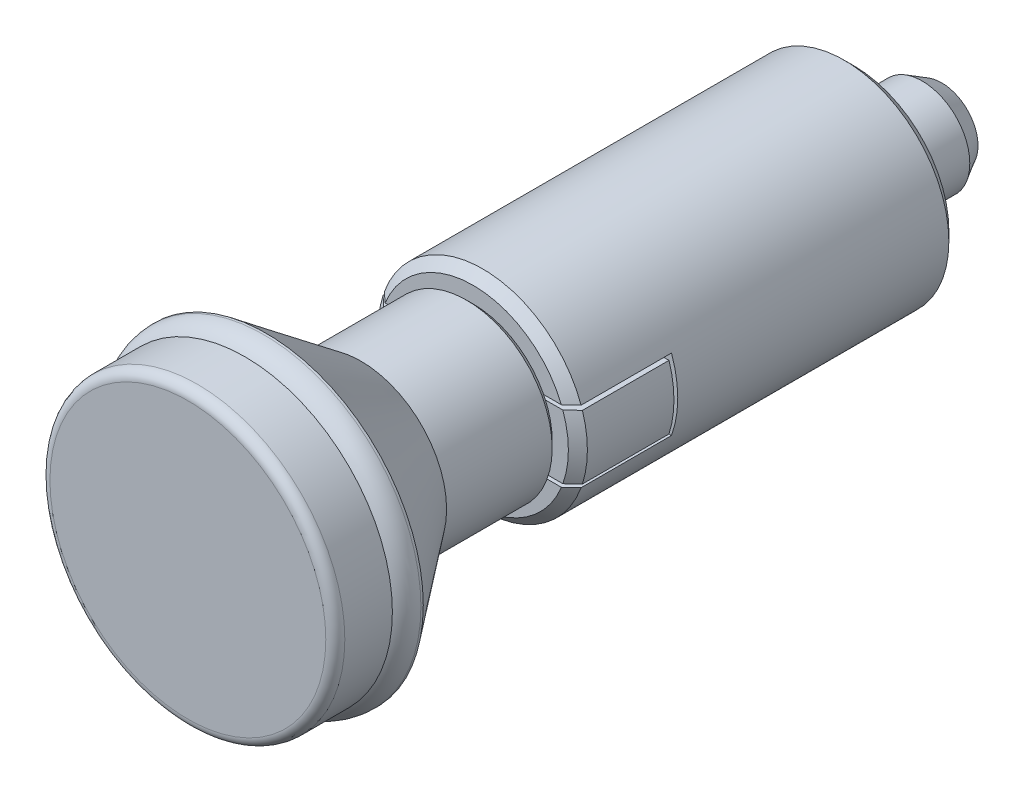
ISO-10303-21;
HEADER;
FILE_DESCRIPTION(('STEP AP214'),'2;1');
FILE_NAME('part.step','',(''),(''),'','','');
FILE_SCHEMA(('AUTOMOTIVE_DESIGN { 1 0 10303 214 1 1 1 1 }'));
ENDSEC;
DATA;
#1=APPLICATION_CONTEXT('core data for automotive mechanical design processes');
#2=APPLICATION_PROTOCOL_DEFINITION('international standard','automotive_design',2000,#1);
#3=PRODUCT_CONTEXT('',#1,'mechanical');
#4=PRODUCT('Part','Part','',(#3));
#5=PRODUCT_RELATED_PRODUCT_CATEGORY('part','',(#4));
#6=PRODUCT_DEFINITION_FORMATION('','',#4);
#7=PRODUCT_DEFINITION_CONTEXT('part definition',#1,'design');
#8=PRODUCT_DEFINITION('design','',#6,#7);
#9=PRODUCT_DEFINITION_SHAPE('','',#8);
#10=(LENGTH_UNIT() NAMED_UNIT(*) SI_UNIT(.MILLI.,.METRE.));
#11=(NAMED_UNIT(*) PLANE_ANGLE_UNIT() SI_UNIT($,.RADIAN.));
#12=(NAMED_UNIT(*) SI_UNIT($,.STERADIAN.) SOLID_ANGLE_UNIT());
#13=UNCERTAINTY_MEASURE_WITH_UNIT(LENGTH_MEASURE(1.E-05),#10,'distance_accuracy_value','');
#14=(GEOMETRIC_REPRESENTATION_CONTEXT(3) GLOBAL_UNCERTAINTY_ASSIGNED_CONTEXT((#13)) GLOBAL_UNIT_ASSIGNED_CONTEXT((#10,
#11,#12)) REPRESENTATION_CONTEXT('',''));
#15=CARTESIAN_POINT('',(0.,0.,0.));
#16=DIRECTION('',(0.,0.,1.));
#17=DIRECTION('',(1.,0.,0.));
#18=AXIS2_PLACEMENT_3D('',#15,#16,#17);
#19=CARTESIAN_POINT('',(0.,10.0000000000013,40.));
#20=DIRECTION('',(0.,0.,1.));
#21=DIRECTION('',(1.,0.,0.));
#22=AXIS2_PLACEMENT_3D('',#19,#20,#21);
#23=PLANE('',#22);
#24=CARTESIAN_POINT('',(0.,0.,40.));
#25=DIRECTION('',(0.,0.,1.));
#26=DIRECTION('',(1.,0.,0.));
#27=AXIS2_PLACEMENT_3D('',#24,#25,#26);
#28=CIRCLE('',#27,10.0000000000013);
#29=CARTESIAN_POINT('',(-9.26830248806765,-3.75480611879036,40.));
#30=VERTEX_POINT('',#29);
#31=CARTESIAN_POINT('',(9.26830248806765,-3.75480611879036,40.));
#32=VERTEX_POINT('',#31);
#33=EDGE_CURVE('E312',#30,#32,#28,.T.);
#34=ORIENTED_EDGE('',*,*,#33,.T.);
#35=DIRECTION('',(1.,0.,0.));
#36=VECTOR('',#35,1.);
#37=CARTESIAN_POINT('',(6.,-3.75480611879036,40.));
#38=LINE('',#37,#36);
#39=CARTESIAN_POINT('',(7.40212341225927,-3.75480611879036,40.));
#40=VERTEX_POINT('',#39);
#41=EDGE_CURVE('E215',#40,#32,#38,.T.);
#42=ORIENTED_EDGE('',*,*,#41,.F.);
#43=CARTESIAN_POINT('',(0.,0.,40.));
#44=DIRECTION('',(0.,0.,1.));
#45=DIRECTION('',(1.,0.,0.));
#46=AXIS2_PLACEMENT_3D('',#43,#44,#45);
#47=CIRCLE('',#46,8.30000000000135);
#48=CARTESIAN_POINT('',(-7.40212341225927,-3.75480611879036,40.));
#49=VERTEX_POINT('',#48);
#50=EDGE_CURVE('E455',#49,#40,#47,.T.);
#51=ORIENTED_EDGE('',*,*,#50,.F.);
#52=DIRECTION('',(-1.,0.,0.));
#53=VECTOR('',#52,1.);
#54=CARTESIAN_POINT('',(-6.,-3.75480611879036,40.));
#55=LINE('',#54,#53);
#56=EDGE_CURVE('E474',#49,#30,#55,.T.);
#57=ORIENTED_EDGE('',*,*,#56,.T.);
#58=EDGE_LOOP('',(#34,#42,#51,#57));
#59=FACE_BOUND('',#58,.T.);
#60=ADVANCED_FACE('F14',(#59),#23,.T.);
#61=CARTESIAN_POINT('',(7.59179003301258,-3.35480611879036,40.));
#62=VERTEX_POINT('',#61);
#63=CARTESIAN_POINT('',(7.59179003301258,3.35480611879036,40.));
#64=VERTEX_POINT('',#63);
#65=EDGE_CURVE('E452',#62,#64,#47,.T.);
#66=ORIENTED_EDGE('',*,*,#65,.F.);
#67=DIRECTION('',(1.,0.,0.));
#68=VECTOR('',#67,1.);
#69=CARTESIAN_POINT('',(6.,-3.35480611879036,40.));
#70=LINE('',#69,#68);
#71=CARTESIAN_POINT('',(9.42047110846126,-3.35480611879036,40.));
#72=VERTEX_POINT('',#71);
#73=EDGE_CURVE('E219',#62,#72,#70,.T.);
#74=ORIENTED_EDGE('',*,*,#73,.T.);
#75=CARTESIAN_POINT('',(9.42047110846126,3.35480611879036,40.));
#76=VERTEX_POINT('',#75);
#77=EDGE_CURVE('E316',#72,#76,#28,.T.);
#78=ORIENTED_EDGE('',*,*,#77,.T.);
#79=DIRECTION('',(1.,0.,0.));
#80=VECTOR('',#79,1.);
#81=CARTESIAN_POINT('',(6.,3.35480611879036,40.));
#82=LINE('',#81,#80);
#83=EDGE_CURVE('E229',#64,#76,#82,.T.);
#84=ORIENTED_EDGE('',*,*,#83,.F.);
#85=EDGE_LOOP('',(#66,#74,#78,#84));
#86=FACE_BOUND('',#85,.T.);
#87=ADVANCED_FACE('F410',(#86),#23,.T.);
#88=CARTESIAN_POINT('',(7.40212341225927,3.75480611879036,40.));
#89=VERTEX_POINT('',#88);
#90=CARTESIAN_POINT('',(-7.40212341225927,3.75480611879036,40.));
#91=VERTEX_POINT('',#90);
#92=EDGE_CURVE('E323',#89,#91,#47,.T.);
#93=ORIENTED_EDGE('',*,*,#92,.F.);
#94=DIRECTION('',(1.,0.,0.));
#95=VECTOR('',#94,1.);
#96=CARTESIAN_POINT('',(6.,3.75480611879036,40.));
#97=LINE('',#96,#95);
#98=CARTESIAN_POINT('',(9.26830248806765,3.75480611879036,40.));
#99=VERTEX_POINT('',#98);
#100=EDGE_CURVE('E192',#89,#99,#97,.T.);
#101=ORIENTED_EDGE('',*,*,#100,.T.);
#102=CARTESIAN_POINT('',(-9.26830248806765,3.75480611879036,40.));
#103=VERTEX_POINT('',#102);
#104=EDGE_CURVE('E317',#99,#103,#28,.T.);
#105=ORIENTED_EDGE('',*,*,#104,.T.);
#106=DIRECTION('',(-1.,0.,0.));
#107=VECTOR('',#106,1.);
#108=CARTESIAN_POINT('',(-6.,3.75480611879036,40.));
#109=LINE('',#108,#107);
#110=EDGE_CURVE('E445',#91,#103,#109,.T.);
#111=ORIENTED_EDGE('',*,*,#110,.F.);
#112=EDGE_LOOP('',(#93,#101,#105,#111));
#113=FACE_BOUND('',#112,.T.);
#114=ADVANCED_FACE('F416',(#113),#23,.T.);
#115=CARTESIAN_POINT('',(0.,0.,40.));
#116=DIRECTION('',(0.,0.,-1.));
#117=DIRECTION('',(-1.,0.,0.));
#118=AXIS2_PLACEMENT_3D('',#115,#116,#117);
#119=CONICAL_SURFACE('',#118,10.0000000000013,0.785398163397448);
#120=CARTESIAN_POINT('',(0.,0.,39.));
#121=DIRECTION('',(0.,0.,1.));
#122=DIRECTION('',(1.,0.,0.));
#123=AXIS2_PLACEMENT_3D('',#120,#121,#122);
#124=CIRCLE('',#123,11.0000000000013);
#125=CARTESIAN_POINT('',(-10.3393148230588,-3.75480611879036,39.));
#126=VERTEX_POINT('',#125);
#127=CARTESIAN_POINT('',(10.3393148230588,-3.75480611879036,39.));
#128=VERTEX_POINT('',#127);
#129=EDGE_CURVE('E307',#126,#128,#124,.T.);
#130=ORIENTED_EDGE('',*,*,#129,.T.);
#131=CARTESIAN_POINT('',(16.9479315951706,-3.75480611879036,32.6411131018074));
#132=CARTESIAN_POINT('',(16.664854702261,-3.75480611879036,32.9174855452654));
#133=CARTESIAN_POINT('',(16.3816188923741,-3.75480611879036,33.1936952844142));
#134=CARTESIAN_POINT('',(15.8147703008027,-3.75480611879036,33.7457276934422));
#135=CARTESIAN_POINT('',(15.5311575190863,-3.75480611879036,34.0215503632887));
#136=CARTESIAN_POINT('',(14.6798049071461,-3.75480611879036,34.8482094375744));
#137=CARTESIAN_POINT('',(14.1114114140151,-3.75480611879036,35.3983731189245));
#138=CARTESIAN_POINT('',(12.9729075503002,-3.75480611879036,36.4954956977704));
#139=CARTESIAN_POINT('',(12.4028002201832,-3.75480611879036,37.0424577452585));
#140=CARTESIAN_POINT('',(11.5448900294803,-3.75480611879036,37.8601623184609));
#141=CARTESIAN_POINT('',(11.2584252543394,-3.75480611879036,38.1323084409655));
#142=CARTESIAN_POINT('',(10.6843846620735,-3.75480611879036,38.6754259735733));
#143=CARTESIAN_POINT('',(10.3968088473,-3.75480611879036,38.9463973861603));
#144=CARTESIAN_POINT('',(9.81962190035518,-3.75480611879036,39.4874636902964));
#145=CARTESIAN_POINT('',(9.53000765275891,-3.75480611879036,39.7575552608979));
#146=CARTESIAN_POINT('',(8.94900943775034,-3.75480611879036,40.2958072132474));
#147=CARTESIAN_POINT('',(8.65762554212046,-3.75480611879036,40.5639676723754));
#148=CARTESIAN_POINT('',(8.07272242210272,-3.75480611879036,41.0975804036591));
#149=CARTESIAN_POINT('',(7.77920465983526,-3.75480611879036,41.3630342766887));
#150=CARTESIAN_POINT('',(7.18904030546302,-3.75480611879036,41.8905442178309));
#151=CARTESIAN_POINT('',(6.89239324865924,-3.75480611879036,42.1525997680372));
#152=CARTESIAN_POINT('',(6.44391133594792,-3.75480611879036,42.5423111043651));
#153=CARTESIAN_POINT('',(6.29366432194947,-3.75480611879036,42.6717939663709));
#154=CARTESIAN_POINT('',(5.99190048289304,-3.75480611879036,42.9292693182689));
#155=CARTESIAN_POINT('',(5.84038367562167,-3.75480611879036,43.0572618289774));
#156=CARTESIAN_POINT('',(5.5358960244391,-3.75480611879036,43.3113766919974));
#157=CARTESIAN_POINT('',(5.38292582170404,-3.75480611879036,43.4374998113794));
#158=CARTESIAN_POINT('',(5.07514585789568,-3.75480611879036,43.6875035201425));
#159=CARTESIAN_POINT('',(4.92033599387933,-3.75480611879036,43.8113839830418));
#160=CARTESIAN_POINT('',(4.60813069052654,-3.75480611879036,44.0565942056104));
#161=CARTESIAN_POINT('',(4.45073015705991,-3.75480611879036,44.1779174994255));
#162=CARTESIAN_POINT('',(4.13320354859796,-3.75480611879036,44.4168997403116));
#163=CARTESIAN_POINT('',(3.97307791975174,-3.75480611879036,44.53455927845));
#164=CARTESIAN_POINT('',(3.6491854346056,-3.75480611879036,44.7652923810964));
#165=CARTESIAN_POINT('',(3.48541371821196,-3.75480611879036,44.8783591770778));
#166=CARTESIAN_POINT('',(3.23653604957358,-3.75480611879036,45.0431984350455));
#167=CARTESIAN_POINT('',(3.15301633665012,-3.75480611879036,45.0973658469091));
#168=CARTESIAN_POINT('',(2.98477870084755,-3.75480611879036,45.2038299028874));
#169=CARTESIAN_POINT('',(2.90006061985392,-3.75480611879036,45.2561262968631));
#170=CARTESIAN_POINT('',(2.81468488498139,-3.75480611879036,45.3073440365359));
#171=B_SPLINE_CURVE_WITH_KNOTS('',3,(#131,#132,#133,#134,#135,#136,#137,#138,#139,#140,#141,
#142,#143,#144,#145,#146,#147,#148,#149,#150,#151,#152,#153,#154,#155,#156,#157,#158,#159,#160,
#161,#162,#163,#164,#165,#166,#167,#168,#169,#170),.UNSPECIFIED.,.F.,.F.,(4,2,2,2,2,2,2,2,2,2,2,
2,2,2,2,2,2,2,2,4),(0.,1.18685644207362,2.3737129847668,4.74684138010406,7.11699863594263,
8.302378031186,9.48775491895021,10.6757858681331,11.8637689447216,13.0510030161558,
14.2384159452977,14.8334376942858,15.4284511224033,16.0232132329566,16.618008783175,
17.2141616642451,17.8102178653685,18.4071227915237,18.7057423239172,19.0044016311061),.UNSPECIFIED.);
#172=EDGE_CURVE('E377',#128,#32,#171,.T.);
#173=ORIENTED_EDGE('',*,*,#172,.T.);
#174=ORIENTED_EDGE('',*,*,#33,.F.);
#175=CARTESIAN_POINT('',(-16.2935373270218,-3.75480611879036,33.2794160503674));
#176=CARTESIAN_POINT('',(-16.0100123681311,-3.75480611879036,33.5556962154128));
#177=CARTESIAN_POINT('',(-15.7263093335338,-3.75480611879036,33.831793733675));
#178=CARTESIAN_POINT('',(-15.1584778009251,-3.75480611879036,34.3835503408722));
#179=CARTESIAN_POINT('',(-14.8743493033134,-3.75480611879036,34.6592094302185));
#180=CARTESIAN_POINT('',(-14.0215073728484,-3.75480611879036,35.4851426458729));
#181=CARTESIAN_POINT('',(-13.4520519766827,-3.75480611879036,36.0346512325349));
#182=CARTESIAN_POINT('',(-12.311604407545,-3.75480611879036,37.1295468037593));
#183=CARTESIAN_POINT('',(-11.7406184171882,-3.75480611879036,37.6749402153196));
#184=CARTESIAN_POINT('',(-10.8808603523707,-3.75480611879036,38.4898543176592));
#185=CARTESIAN_POINT('',(-10.5936567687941,-3.75480611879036,38.761029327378));
#186=CARTESIAN_POINT('',(-10.0179214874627,-3.75480611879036,39.3019828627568));
#187=CARTESIAN_POINT('',(-9.72938975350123,-3.75480611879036,39.5717613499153));
#188=CARTESIAN_POINT('',(-9.14944448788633,-3.75480611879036,40.1106438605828));
#189=CARTESIAN_POINT('',(-8.85802395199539,-3.75480611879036,40.3797403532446));
#190=CARTESIAN_POINT('',(-8.27302420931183,-3.75480611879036,40.915525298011));
#191=CARTESIAN_POINT('',(-7.9794452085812,-3.75480611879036,41.1822139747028));
#192=CARTESIAN_POINT('',(-7.38977086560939,-3.75480611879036,41.7120244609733));
#193=CARTESIAN_POINT('',(-7.09367928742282,-3.75480611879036,41.9751504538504));
#194=CARTESIAN_POINT('',(-6.49745954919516,-3.75480611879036,42.4970251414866));
#195=CARTESIAN_POINT('',(-6.19733001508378,-3.75480611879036,42.755772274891));
#196=CARTESIAN_POINT('',(-5.7423085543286,-3.75480611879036,43.1395285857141));
#197=CARTESIAN_POINT('',(-5.58948965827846,-3.75480611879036,43.2669947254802));
#198=CARTESIAN_POINT('',(-5.28216119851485,-3.75480611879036,43.5198652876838));
#199=CARTESIAN_POINT('',(-5.12765169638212,-3.75480611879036,43.6452697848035));
#200=CARTESIAN_POINT('',(-4.81673290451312,-3.75480611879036,43.8933875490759));
#201=CARTESIAN_POINT('',(-4.66032565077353,-3.75480611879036,44.0161033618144));
#202=CARTESIAN_POINT('',(-4.34497658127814,-3.75480611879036,44.2582945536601));
#203=CARTESIAN_POINT('',(-4.18603439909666,-3.75480611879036,44.3777694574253));
#204=CARTESIAN_POINT('',(-3.86426973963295,-3.75480611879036,44.6130674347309));
#205=CARTESIAN_POINT('',(-3.70143213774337,-3.75480611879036,44.7288698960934));
#206=CARTESIAN_POINT('',(-3.37192753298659,-3.75480611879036,44.9547987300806));
#207=CARTESIAN_POINT('',(-3.20526215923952,-3.75480611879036,45.0649274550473));
#208=CARTESIAN_POINT('',(-2.9513604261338,-3.75480611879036,45.2245659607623));
#209=CARTESIAN_POINT('',(-2.86592339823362,-3.75480611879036,45.2769395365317));
#210=CARTESIAN_POINT('',(-2.69370446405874,-3.75480611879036,45.3794135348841));
#211=CARTESIAN_POINT('',(-2.60692269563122,-3.75480611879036,45.4295141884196));
#212=CARTESIAN_POINT('',(-2.43174417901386,-3.75480611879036,45.5271214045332));
#213=CARTESIAN_POINT('',(-2.34334532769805,-3.75480611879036,45.5746242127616));
#214=CARTESIAN_POINT('',(-2.1648847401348,-3.75480611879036,45.6664709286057));
#215=CARTESIAN_POINT('',(-2.07482241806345,-3.75480611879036,45.7108136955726));
#216=CARTESIAN_POINT('',(-1.98387652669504,-3.75480611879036,45.7533148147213));
#217=B_SPLINE_CURVE_WITH_KNOTS('',3,(#175,#176,#177,#178,#179,#180,#181,#182,#183,#184,#185,
#186,#187,#188,#189,#190,#191,#192,#193,#194,#195,#196,#197,#198,#199,#200,#201,#202,#203,#204,
#205,#206,#207,#208,#209,#210,#211,#212,#213,#214,#215,#216),.UNSPECIFIED.,.F.,.F.,(4,2,2,2,2,2,
2,2,2,2,2,2,2,2,2,2,2,2,2,2,4),(0.,1.18762541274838,2.37524971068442,4.74930171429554,
7.11810409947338,8.30308839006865,9.48810517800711,10.6780744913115,11.8679316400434,
13.0562431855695,14.2449698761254,14.8419580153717,15.4389244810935,16.0352989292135,
16.6317603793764,17.2311258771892,17.8302408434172,18.1308492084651,18.4314269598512,
18.7324282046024,19.0335375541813),.UNSPECIFIED.);
#218=EDGE_CURVE('E482',#126,#30,#217,.T.);
#219=ORIENTED_EDGE('',*,*,#218,.F.);
#220=EDGE_LOOP('',(#130,#173,#174,#219));
#221=FACE_BOUND('',#220,.T.);
#222=ADVANCED_FACE('F428',(#221),#119,.T.);
#223=ORIENTED_EDGE('',*,*,#77,.F.);
#224=CARTESIAN_POINT('',(2.99323730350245,-3.35480611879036,45.5039802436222));
#225=CARTESIAN_POINT('',(3.08526724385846,-3.35480611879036,45.4426952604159));
#226=CARTESIAN_POINT('',(3.17657931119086,-3.35480611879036,45.380346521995));
#227=CARTESIAN_POINT('',(3.35792178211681,-3.35480611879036,45.2538325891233));
#228=CARTESIAN_POINT('',(3.44795233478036,-3.35480611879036,45.1896676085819));
#229=CARTESIAN_POINT('',(3.62686829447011,-3.35480611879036,45.0598460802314));
#230=CARTESIAN_POINT('',(3.71575418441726,-3.35480611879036,44.994190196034));
#231=CARTESIAN_POINT('',(3.89255831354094,-3.35480611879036,44.8615840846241));
#232=CARTESIAN_POINT('',(3.98047652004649,-3.35480611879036,44.7946338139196));
#233=CARTESIAN_POINT('',(4.24277380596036,-3.35480611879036,44.5922790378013));
#234=CARTESIAN_POINT('',(4.41588566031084,-3.35480611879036,44.4552313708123));
#235=CARTESIAN_POINT('',(4.75949308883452,-3.35480611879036,44.1778661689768));
#236=CARTESIAN_POINT('',(4.92998831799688,-3.35480611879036,44.0375482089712));
#237=CARTESIAN_POINT('',(5.26863309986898,-3.35480611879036,43.7546356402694));
#238=CARTESIAN_POINT('',(5.43678584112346,-3.35480611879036,43.6120448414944));
#239=CARTESIAN_POINT('',(5.77141485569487,-3.35480611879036,43.3249287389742));
#240=CARTESIAN_POINT('',(5.93789120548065,-3.35480611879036,43.1804035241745));
#241=CARTESIAN_POINT('',(6.2695366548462,-3.35480611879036,42.8897654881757));
#242=CARTESIAN_POINT('',(6.43470535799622,-3.35480611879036,42.7436522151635));
#243=CARTESIAN_POINT('',(6.76392788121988,-3.35480611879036,42.450172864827));
#244=CARTESIAN_POINT('',(6.92798168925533,-3.35480611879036,42.3028067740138));
#245=CARTESIAN_POINT('',(7.35172644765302,-3.35480611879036,41.9197654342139));
#246=CARTESIAN_POINT('',(7.61071047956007,-3.35480611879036,41.6833083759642));
#247=CARTESIAN_POINT('',(8.12687620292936,-3.35480611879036,41.2084909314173));
#248=CARTESIAN_POINT('',(8.38405807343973,-3.35480611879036,40.9701307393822));
#249=CARTESIAN_POINT('',(8.89718621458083,-3.35480611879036,40.4917922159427));
#250=CARTESIAN_POINT('',(9.1531316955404,-3.35480611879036,40.251813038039));
#251=CARTESIAN_POINT('',(9.66393099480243,-3.35480611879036,39.7706809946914));
#252=CARTESIAN_POINT('',(9.91878477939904,-3.35480611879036,39.5295280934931));
#253=CARTESIAN_POINT('',(10.7468937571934,-3.35480611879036,38.7430958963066));
#254=CARTESIAN_POINT('',(11.3183646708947,-3.35480611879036,38.1959382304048));
#255=CARTESIAN_POINT('',(12.4584580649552,-3.35480611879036,37.098673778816));
#256=CARTESIAN_POINT('',(13.0270805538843,-3.35480611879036,36.5485670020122));
#257=CARTESIAN_POINT('',(14.1615858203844,-3.35480611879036,35.4471034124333));
#258=CARTESIAN_POINT('',(14.7274712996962,-3.35480611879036,34.8957493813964));
#259=CARTESIAN_POINT('',(15.5752537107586,-3.35480611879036,34.0676546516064));
#260=CARTESIAN_POINT('',(15.8576720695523,-3.35480611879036,33.7914472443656));
#261=CARTESIAN_POINT('',(16.4222075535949,-3.35480611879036,33.2387252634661));
#262=CARTESIAN_POINT('',(16.7043246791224,-3.35480611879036,32.9622106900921));
#263=CARTESIAN_POINT('',(16.986314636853,-3.35480611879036,32.6855664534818));
#264=B_SPLINE_CURVE_WITH_KNOTS('',3,(#224,#225,#226,#227,#228,#229,#230,#231,#232,#233,#234,
#235,#236,#237,#238,#239,#240,#241,#242,#243,#244,#245,#246,#247,#248,#249,#250,#251,#252,#253,
#254,#255,#256,#257,#258,#259,#260,#261,#262,#263),.UNSPECIFIED.,.F.,.F.,(4,2,2,2,2,2,2,2,2,2,2,
2,2,2,2,2,2,2,2,4),(0.,0.331686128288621,0.663333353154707,0.994835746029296,1.32634929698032,
1.98866976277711,2.65107682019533,3.31247084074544,3.97383455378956,4.63539162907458,
5.29695583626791,6.34901644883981,7.40097101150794,8.45352644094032,9.50611413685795,
11.8796239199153,14.2531265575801,16.6233459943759,17.8084432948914,18.9935394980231),.UNSPECIFIED.);
#265=CARTESIAN_POINT('',(10.4759379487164,-3.35480611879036,39.));
#266=VERTEX_POINT('',#265);
#267=EDGE_CURVE('E369',#72,#266,#264,.T.);
#268=ORIENTED_EDGE('',*,*,#267,.T.);
#269=CARTESIAN_POINT('',(10.4759379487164,3.35480611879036,39.));
#270=VERTEX_POINT('',#269);
#271=EDGE_CURVE('E311',#266,#270,#124,.T.);
#272=ORIENTED_EDGE('',*,*,#271,.T.);
#273=CARTESIAN_POINT('',(16.986314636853,3.35480611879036,32.6855664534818));
#274=CARTESIAN_POINT('',(16.7039906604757,3.35480611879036,32.9625383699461));
#275=CARTESIAN_POINT('',(16.4215392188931,3.35480611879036,33.2393803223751));
#276=CARTESIAN_POINT('',(15.8563345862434,3.35480611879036,33.7927560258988));
#277=CARTESIAN_POINT('',(15.5735813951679,3.35480611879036,34.0692897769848));
#278=CARTESIAN_POINT('',(14.7248894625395,3.35480611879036,34.8982679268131));
#279=CARTESIAN_POINT('',(14.158428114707,3.35480611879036,35.4501778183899));
#280=CARTESIAN_POINT('',(13.0240078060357,3.35480611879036,36.5515415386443));
#281=CARTESIAN_POINT('',(12.456050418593,3.35480611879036,37.10099698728));
#282=CARTESIAN_POINT('',(11.3172017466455,3.35480611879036,38.1970513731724));
#283=CARTESIAN_POINT('',(10.7463100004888,3.35480611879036,38.7436498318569));
#284=CARTESIAN_POINT('',(9.88623550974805,3.35480611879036,39.560439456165));
#285=CARTESIAN_POINT('',(9.59871355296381,3.35480611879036,39.8323786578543));
#286=CARTESIAN_POINT('',(9.02223999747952,3.35480611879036,40.3747234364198));
#287=CARTESIAN_POINT('',(8.7332884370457,3.35480611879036,40.645129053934));
#288=CARTESIAN_POINT('',(8.15363417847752,3.35480611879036,41.1838211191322));
#289=CARTESIAN_POINT('',(7.8629322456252,3.35480611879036,41.4521083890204));
#290=CARTESIAN_POINT('',(7.27899909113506,3.35480611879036,41.985978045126));
#291=CARTESIAN_POINT('',(6.98576762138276,3.35480611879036,42.2515601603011));
#292=CARTESIAN_POINT('',(6.39544797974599,3.35480611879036,42.7792773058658));
#293=CARTESIAN_POINT('',(6.09835489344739,3.35480611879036,43.0414068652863));
#294=CARTESIAN_POINT('',(5.64905831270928,3.35480611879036,43.4302948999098));
#295=CARTESIAN_POINT('',(5.49870424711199,3.35480611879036,43.5591890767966));
#296=CARTESIAN_POINT('',(5.19648242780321,3.35480611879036,43.8152054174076));
#297=CARTESIAN_POINT('',(5.04461461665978,3.35480611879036,43.9423275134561));
#298=CARTESIAN_POINT('',(4.73880651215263,3.35480611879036,44.1945268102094));
#299=CARTESIAN_POINT('',(4.58486347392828,3.35480611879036,44.3196006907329));
#300=CARTESIAN_POINT('',(4.27469811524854,3.35480611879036,44.5668612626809));
#301=CARTESIAN_POINT('',(4.11847604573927,3.35480611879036,44.689048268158));
#302=CARTESIAN_POINT('',(3.8030012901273,3.35480611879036,44.9297813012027));
#303=CARTESIAN_POINT('',(3.64374590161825,3.35480611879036,45.0483238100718));
#304=CARTESIAN_POINT('',(3.40209474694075,3.35480611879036,45.2223583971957));
#305=CARTESIAN_POINT('',(3.32106754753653,3.35480611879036,45.2797504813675));
#306=CARTESIAN_POINT('',(3.15796682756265,3.35480611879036,45.3930429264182));
#307=CARTESIAN_POINT('',(3.07589321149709,3.35480611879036,45.4489431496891));
#308=CARTESIAN_POINT('',(2.99323730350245,3.35480611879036,45.5039802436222));
#309=B_SPLINE_CURVE_WITH_KNOTS('',3,(#273,#274,#275,#276,#277,#278,#279,#280,#281,#282,#283,
#284,#285,#286,#287,#288,#289,#290,#291,#292,#293,#294,#295,#296,#297,#298,#299,#300,#301,#302,
#303,#304,#305,#306,#307,#308),.UNSPECIFIED.,.F.,.F.,(4,2,2,2,2,2,2,2,2,2,2,2,2,2,2,2,2,4),(0.,
1.18649994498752,2.37299992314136,4.7456204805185,7.11633035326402,9.4874253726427,
10.6746778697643,11.8618987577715,13.0486336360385,14.2354862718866,15.4240356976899,
16.0181468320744,16.6122805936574,17.2072974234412,17.8022492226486,18.3977584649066,
18.6956249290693,18.9935187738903),.UNSPECIFIED.);
#310=EDGE_CURVE('E239',#270,#76,#309,.T.);
#311=ORIENTED_EDGE('',*,*,#310,.T.);
#312=EDGE_LOOP('',(#223,#268,#272,#311));
#313=FACE_BOUND('',#312,.T.);
#314=ADVANCED_FACE('F374',(#313),#119,.T.);
#315=ORIENTED_EDGE('',*,*,#104,.F.);
#316=CARTESIAN_POINT('',(2.81468488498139,3.75480611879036,45.3073440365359));
#317=CARTESIAN_POINT('',(2.91407415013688,3.75480611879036,45.247710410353));
#318=CARTESIAN_POINT('',(3.01257708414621,3.75480611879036,45.1866253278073));
#319=CARTESIAN_POINT('',(3.20798247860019,3.75480611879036,45.061983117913));
#320=CARTESIAN_POINT('',(3.30488523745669,3.75480611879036,44.9984264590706));
#321=CARTESIAN_POINT('',(3.49723237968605,3.75480611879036,44.8692944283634));
#322=CARTESIAN_POINT('',(3.5926777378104,3.75480611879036,44.8037205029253));
#323=CARTESIAN_POINT('',(3.78234673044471,3.75480611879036,44.6708216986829));
#324=CARTESIAN_POINT('',(3.87657029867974,3.75480611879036,44.6034967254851));
#325=CARTESIAN_POINT('',(4.15731426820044,3.75480611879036,44.3995305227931));
#326=CARTESIAN_POINT('',(4.34222971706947,3.75480611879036,44.2606793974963));
#327=CARTESIAN_POINT('',(4.70873841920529,3.75480611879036,43.9786105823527));
#328=CARTESIAN_POINT('',(4.89033096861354,3.75480611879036,43.8353919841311));
#329=CARTESIAN_POINT('',(5.25043319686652,3.75480611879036,43.5459958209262));
#330=CARTESIAN_POINT('',(5.42894913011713,3.75480611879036,43.3998260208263));
#331=CARTESIAN_POINT('',(5.78384648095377,3.75480611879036,43.1049503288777));
#332=CARTESIAN_POINT('',(5.96022805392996,3.75480611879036,42.9562446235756));
#333=CARTESIAN_POINT('',(6.31134948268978,3.75480611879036,42.6567511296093));
#334=CARTESIAN_POINT('',(6.48608856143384,3.75480611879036,42.5059624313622));
#335=CARTESIAN_POINT('',(6.83415466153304,3.75480611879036,42.202760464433));
#336=CARTESIAN_POINT('',(7.00748165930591,3.75480611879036,42.0503471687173));
#337=CARTESIAN_POINT('',(7.42776387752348,3.75480611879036,41.6779174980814));
#338=CARTESIAN_POINT('',(7.67410237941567,3.75480611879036,41.4572055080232));
#339=CARTESIAN_POINT('',(8.16487271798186,3.75480611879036,41.0137497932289));
#340=CARTESIAN_POINT('',(8.40930483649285,3.75480611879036,40.7910063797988));
#341=CARTESIAN_POINT('',(8.89687885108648,3.75480611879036,40.3437273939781));
#342=CARTESIAN_POINT('',(9.14001957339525,3.75480611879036,40.1191905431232));
#343=CARTESIAN_POINT('',(9.62511558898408,3.75480611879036,39.6688186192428));
#344=CARTESIAN_POINT('',(9.86707082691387,3.75480611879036,39.4429834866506));
#345=CARTESIAN_POINT('',(10.3972406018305,3.75480611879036,38.9459934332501));
#346=CARTESIAN_POINT('',(10.6852455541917,3.75480611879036,38.6746150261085));
#347=CARTESIAN_POINT('',(11.2601418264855,3.75480611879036,38.130680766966));
#348=CARTESIAN_POINT('',(11.5470331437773,3.75480611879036,37.8581249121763));
#349=CARTESIAN_POINT('',(12.4063608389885,3.75480611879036,37.0390532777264));
#350=CARTESIAN_POINT('',(12.9774550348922,3.75480611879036,36.4911295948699));
#351=CARTESIAN_POINT('',(14.1160883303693,3.75480611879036,35.3938500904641));
#352=CARTESIAN_POINT('',(14.6836322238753,3.75480611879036,34.844499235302));
#353=CARTESIAN_POINT('',(15.5336401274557,3.75480611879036,34.0191367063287));
#354=CARTESIAN_POINT('',(15.8167556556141,3.75480611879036,33.7437955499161));
#355=CARTESIAN_POINT('',(16.3826107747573,3.75480611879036,33.1927280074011));
#356=CARTESIAN_POINT('',(16.6653503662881,3.75480611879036,32.9170016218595));
#357=CARTESIAN_POINT('',(16.9479315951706,3.75480611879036,32.6411131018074));
#358=B_SPLINE_CURVE_WITH_KNOTS('',3,(#316,#317,#318,#319,#320,#321,#322,#323,#324,#325,#326,
#327,#328,#329,#330,#331,#332,#333,#334,#335,#336,#337,#338,#339,#340,#341,#342,#343,#344,#345,
#346,#347,#348,#349,#350,#351,#352,#353,#354,#355,#356,#357),.UNSPECIFIED.,.F.,.F.,(4,2,2,2,2,2,
2,2,2,2,2,2,2,2,2,2,2,2,2,2,4),(0.,0.347688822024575,0.695312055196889,1.04269159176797,
1.39008989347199,2.0837200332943,2.77749543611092,3.46963657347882,4.16172701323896,
4.85412987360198,5.54654427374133,6.53878165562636,7.5308694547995,8.52374215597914,
9.51666078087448,10.7038117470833,11.8909655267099,14.2652563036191,16.6348574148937,
17.8196374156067,19.0044156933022),.UNSPECIFIED.);
#359=CARTESIAN_POINT('',(10.3393148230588,3.75480611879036,39.));
#360=VERTEX_POINT('',#359);
#361=EDGE_CURVE('E211',#99,#360,#358,.T.);
#362=ORIENTED_EDGE('',*,*,#361,.T.);
#363=CARTESIAN_POINT('',(-10.3393148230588,3.75480611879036,39.));
#364=VERTEX_POINT('',#363);
#365=EDGE_CURVE('E306',#360,#364,#124,.T.);
#366=ORIENTED_EDGE('',*,*,#365,.T.);
#367=CARTESIAN_POINT('',(-1.98387652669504,3.75480611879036,45.7533148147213));
#368=CARTESIAN_POINT('',(-2.06418758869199,3.75480611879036,45.7157895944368));
#369=CARTESIAN_POINT('',(-2.14380713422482,3.75480611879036,45.676821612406));
#370=CARTESIAN_POINT('',(-2.30174070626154,3.75480611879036,45.5963707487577));
#371=CARTESIAN_POINT('',(-2.38005507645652,3.75480611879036,45.5548885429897));
#372=CARTESIAN_POINT('',(-2.61303840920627,3.75480611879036,45.4272945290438));
#373=CARTESIAN_POINT('',(-2.76593523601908,3.75480611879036,45.3379457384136));
#374=CARTESIAN_POINT('',(-3.0672671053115,3.75480611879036,45.1530834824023));
#375=CARTESIAN_POINT('',(-3.21571430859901,3.75480611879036,45.0575896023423));
#376=CARTESIAN_POINT('',(-3.50938051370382,3.75480611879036,44.8616774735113));
#377=CARTESIAN_POINT('',(-3.65459841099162,3.75480611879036,44.761257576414));
#378=CARTESIAN_POINT('',(-3.94163965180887,3.75480611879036,44.557117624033));
#379=CARTESIAN_POINT('',(-4.08347589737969,3.75480611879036,44.4534156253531));
#380=CARTESIAN_POINT('',(-4.36491357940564,3.75480611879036,44.2430645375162));
#381=CARTESIAN_POINT('',(-4.50451527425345,3.75480611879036,44.1364157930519));
#382=CARTESIAN_POINT('',(-4.78200235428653,3.75480611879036,43.9206496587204));
#383=CARTESIAN_POINT('',(-4.91988601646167,3.75480611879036,43.8115300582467));
#384=CARTESIAN_POINT('',(-5.19410794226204,3.75480611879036,43.5913611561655));
#385=CARTESIAN_POINT('',(-5.33044615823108,3.75480611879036,43.4803117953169));
#386=CARTESIAN_POINT('',(-5.63680311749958,3.75480611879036,43.2277946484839));
#387=CARTESIAN_POINT('',(-5.80644207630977,3.75480611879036,43.0858665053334));
#388=CARTESIAN_POINT('',(-6.14403634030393,3.75480611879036,42.8000196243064));
#389=CARTESIAN_POINT('',(-6.3119916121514,3.75480611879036,42.6561008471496));
#390=CARTESIAN_POINT('',(-6.81367103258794,3.75480611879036,42.2220571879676));
#391=CARTESIAN_POINT('',(-7.14532895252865,3.75480611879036,41.9295449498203));
#392=CARTESIAN_POINT('',(-7.80573841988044,3.75480611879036,41.3393853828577));
#393=CARTESIAN_POINT('',(-8.13447890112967,3.75480611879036,41.0417257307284));
#394=CARTESIAN_POINT('',(-8.78917134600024,3.75480611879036,40.4433015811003));
#395=CARTESIAN_POINT('',(-9.11512306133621,3.75480611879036,40.1425368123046));
#396=CARTESIAN_POINT('',(-9.73050053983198,3.75480611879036,39.5707277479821));
#397=CARTESIAN_POINT('',(-10.0201375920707,3.75480611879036,39.2999104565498));
#398=CARTESIAN_POINT('',(-10.5980828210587,3.75480611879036,38.7568607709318));
#399=CARTESIAN_POINT('',(-10.8863909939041,3.75480611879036,38.4846283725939));
#400=CARTESIAN_POINT('',(-11.749723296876,3.75480611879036,37.6662768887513));
#401=CARTESIAN_POINT('',(-12.3231677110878,3.75480611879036,37.1184918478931));
#402=CARTESIAN_POINT('',(-13.4638551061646,3.75480611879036,36.0232725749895));
#403=CARTESIAN_POINT('',(-14.0311146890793,3.75480611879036,35.4758555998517));
#404=CARTESIAN_POINT('',(-14.8805290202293,3.75480611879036,34.6532160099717));
#405=CARTESIAN_POINT('',(-15.1634193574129,3.75480611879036,34.3787523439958));
#406=CARTESIAN_POINT('',(-15.728777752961,3.75480611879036,33.8293914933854));
#407=CARTESIAN_POINT('',(-16.0112458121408,3.75480611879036,33.5544943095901));
#408=CARTESIAN_POINT('',(-16.2935373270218,3.75480611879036,33.2794160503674));
#409=B_SPLINE_CURVE_WITH_KNOTS('',3,(#367,#368,#369,#370,#371,#372,#373,#374,#375,#376,#377,
#378,#379,#380,#381,#382,#383,#384,#385,#386,#387,#388,#389,#390,#391,#392,#393,#394,#395,#396,
#397,#398,#399,#400,#401,#402,#403,#404,#405,#406,#407,#408),.UNSPECIFIED.,.F.,.F.,(4,2,2,2,2,2,
2,2,2,2,2,2,2,2,2,2,2,2,2,2,4),(0.,0.265897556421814,0.531723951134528,1.06275394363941,
1.59216810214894,2.12176063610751,2.64882328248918,3.17582453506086,3.70331752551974,
4.2308267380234,4.89434903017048,5.55788443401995,6.88448627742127,8.21489354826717,
9.54541805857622,10.7349859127,11.9245572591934,14.3036486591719,16.6686032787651,
17.8510643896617,19.0335232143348),.UNSPECIFIED.);
#410=EDGE_CURVE('E272',#103,#364,#409,.T.);
#411=ORIENTED_EDGE('',*,*,#410,.F.);
#412=EDGE_LOOP('',(#315,#362,#366,#411));
#413=FACE_BOUND('',#412,.T.);
#414=ADVANCED_FACE('F429',(#413),#119,.T.);
#415=CARTESIAN_POINT('',(0.,0.,70.));
#416=DIRECTION('',(0.,0.,1.));
#417=DIRECTION('',(1.,0.,0.));
#418=AXIS2_PLACEMENT_3D('',#415,#416,#417);
#419=CYLINDRICAL_SURFACE('',#418,11.0000000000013);
#420=CARTESIAN_POINT('',(0.,0.,1.));
#421=DIRECTION('',(0.,0.,1.));
#422=DIRECTION('',(1.,0.,0.));
#423=AXIS2_PLACEMENT_3D('',#420,#421,#422);
#424=CIRCLE('',#423,11.0000000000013);
#425=CARTESIAN_POINT('',(11.0000000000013,0.,1.));
#426=VERTEX_POINT('',#425);
#427=EDGE_CURVE('E303',#426,#426,#424,.T.);
#428=ORIENTED_EDGE('',*,*,#427,.T.);
#429=EDGE_LOOP('',(#428));
#430=FACE_BOUND('',#429,.T.);
#431=CARTESIAN_POINT('',(0.,0.,29.5));
#432=DIRECTION('',(0.,0.,1.));
#433=DIRECTION('',(1.,0.,0.));
#434=AXIS2_PLACEMENT_3D('',#431,#432,#433);
#435=CIRCLE('',#434,11.0000000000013);
#436=CARTESIAN_POINT('',(10.3393148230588,3.75480611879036,29.5));
#437=VERTEX_POINT('',#436);
#438=CARTESIAN_POINT('',(10.3393148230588,-3.75480611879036,29.5));
#439=VERTEX_POINT('',#438);
#440=EDGE_CURVE('E190',#437,#439,#435,.F.);
#441=ORIENTED_EDGE('',*,*,#440,.T.);
#442=DIRECTION('',(0.,0.,1.));
#443=VECTOR('',#442,1.);
#444=CARTESIAN_POINT('',(10.3393148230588,-3.75480611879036,70.));
#445=LINE('',#444,#443);
#446=EDGE_CURVE('E9',#439,#128,#445,.T.);
#447=ORIENTED_EDGE('',*,*,#446,.T.);
#448=ORIENTED_EDGE('',*,*,#129,.F.);
#449=DIRECTION('',(0.,0.,1.));
#450=VECTOR('',#449,1.);
#451=CARTESIAN_POINT('',(-10.3393148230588,-3.75480611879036,70.));
#452=LINE('',#451,#450);
#453=CARTESIAN_POINT('',(-10.3393148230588,-3.75480611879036,29.5));
#454=VERTEX_POINT('',#453);
#455=EDGE_CURVE('E348',#454,#126,#452,.T.);
#456=ORIENTED_EDGE('',*,*,#455,.F.);
#457=CARTESIAN_POINT('',(0.,0.,29.5));
#458=DIRECTION('',(0.,0.,-1.));
#459=DIRECTION('',(-1.,0.,0.));
#460=AXIS2_PLACEMENT_3D('',#457,#458,#459);
#461=CIRCLE('',#460,11.0000000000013);
#462=CARTESIAN_POINT('',(-10.3393148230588,3.75480611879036,29.5));
#463=VERTEX_POINT('',#462);
#464=EDGE_CURVE('E37',#463,#454,#461,.F.);
#465=ORIENTED_EDGE('',*,*,#464,.F.);
#466=DIRECTION('',(0.,0.,1.));
#467=VECTOR('',#466,1.);
#468=CARTESIAN_POINT('',(-10.3393148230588,3.75480611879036,70.));
#469=LINE('',#468,#467);
#470=EDGE_CURVE('E346',#364,#463,#469,.F.);
#471=ORIENTED_EDGE('',*,*,#470,.F.);
#472=ORIENTED_EDGE('',*,*,#365,.F.);
#473=DIRECTION('',(0.,0.,1.));
#474=VECTOR('',#473,1.);
#475=CARTESIAN_POINT('',(10.3393148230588,3.75480611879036,70.));
#476=LINE('',#475,#474);
#477=EDGE_CURVE('E357',#360,#437,#476,.F.);
#478=ORIENTED_EDGE('',*,*,#477,.T.);
#479=EDGE_LOOP('',(#441,#447,#448,#456,#465,#471,#472,#478));
#480=FACE_BOUND('',#479,.T.);
#481=ADVANCED_FACE('F525',(#430,#480),#419,.T.);
#482=ORIENTED_EDGE('',*,*,#271,.F.);
#483=DIRECTION('',(0.,0.,1.));
#484=VECTOR('',#483,1.);
#485=CARTESIAN_POINT('',(10.4759379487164,-3.35480611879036,70.));
#486=LINE('',#485,#484);
#487=CARTESIAN_POINT('',(10.4759379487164,-3.35480611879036,29.9));
#488=VERTEX_POINT('',#487);
#489=EDGE_CURVE('E22',#266,#488,#486,.F.);
#490=ORIENTED_EDGE('',*,*,#489,.T.);
#491=CARTESIAN_POINT('',(0.,0.,29.9));
#492=DIRECTION('',(0.,0.,-1.));
#493=DIRECTION('',(-1.,0.,0.));
#494=AXIS2_PLACEMENT_3D('',#491,#492,#493);
#495=CIRCLE('',#494,11.0000000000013);
#496=CARTESIAN_POINT('',(10.4759379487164,3.35480611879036,29.9));
#497=VERTEX_POINT('',#496);
#498=EDGE_CURVE('E353',#488,#497,#495,.F.);
#499=ORIENTED_EDGE('',*,*,#498,.T.);
#500=DIRECTION('',(0.,0.,1.));
#501=VECTOR('',#500,1.);
#502=CARTESIAN_POINT('',(10.4759379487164,3.35480611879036,70.));
#503=LINE('',#502,#501);
#504=EDGE_CURVE('E359',#497,#270,#503,.T.);
#505=ORIENTED_EDGE('',*,*,#504,.T.);
#506=EDGE_LOOP('',(#482,#490,#499,#505));
#507=FACE_BOUND('',#506,.T.);
#508=ADVANCED_FACE('F364',(#507),#419,.T.);
#509=CARTESIAN_POINT('',(0.,0.,29.9));
#510=DIRECTION('',(0.,0.,1.));
#511=DIRECTION('',(1.,0.,0.));
#512=AXIS2_PLACEMENT_3D('',#509,#510,#511);
#513=CIRCLE('',#512,11.0000000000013);
#514=CARTESIAN_POINT('',(-10.4759379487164,-3.35480611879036,29.9));
#515=VERTEX_POINT('',#514);
#516=CARTESIAN_POINT('',(-10.4759379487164,3.35480611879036,29.9));
#517=VERTEX_POINT('',#516);
#518=EDGE_CURVE('E341',#515,#517,#513,.F.);
#519=ORIENTED_EDGE('',*,*,#518,.F.);
#520=DIRECTION('',(0.,0.,1.));
#521=VECTOR('',#520,1.);
#522=CARTESIAN_POINT('',(-10.4759379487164,-3.35480611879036,70.));
#523=LINE('',#522,#521);
#524=CARTESIAN_POINT('',(-10.4759379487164,-3.35480611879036,39.));
#525=VERTEX_POINT('',#524);
#526=EDGE_CURVE('E350',#525,#515,#523,.F.);
#527=ORIENTED_EDGE('',*,*,#526,.F.);
#528=CARTESIAN_POINT('',(-10.4759379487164,3.35480611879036,39.));
#529=VERTEX_POINT('',#528);
#530=EDGE_CURVE('E310',#529,#525,#124,.T.);
#531=ORIENTED_EDGE('',*,*,#530,.F.);
#532=DIRECTION('',(0.,0.,1.));
#533=VECTOR('',#532,1.);
#534=CARTESIAN_POINT('',(-10.4759379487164,3.35480611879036,70.));
#535=LINE('',#534,#533);
#536=EDGE_CURVE('E343',#517,#529,#535,.T.);
#537=ORIENTED_EDGE('',*,*,#536,.F.);
#538=EDGE_LOOP('',(#519,#527,#531,#537));
#539=FACE_BOUND('',#538,.T.);
#540=ADVANCED_FACE('F528',(#539),#419,.T.);
#541=CARTESIAN_POINT('',(0.,0.,69.));
#542=DIRECTION('',(0.,0.,1.));
#543=DIRECTION('',(1.,0.,0.));
#544=AXIS2_PLACEMENT_3D('',#541,#542,#543);
#545=TOROIDAL_SURFACE('',#544,14.5,0.999999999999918);
#546=CARTESIAN_POINT('',(0.,0.,69.));
#547=DIRECTION('',(0.,0.,1.));
#548=DIRECTION('',(1.,0.,0.));
#549=AXIS2_PLACEMENT_3D('',#546,#547,#548);
#550=CIRCLE('',#549,15.5);
#551=CARTESIAN_POINT('',(15.5,0.,69.));
#552=VERTEX_POINT('',#551);
#553=EDGE_CURVE('E338',#552,#552,#550,.T.);
#554=ORIENTED_EDGE('',*,*,#553,.T.);
#555=EDGE_LOOP('',(#554));
#556=FACE_BOUND('',#555,.T.);
#557=CARTESIAN_POINT('',(0.,0.,70.));
#558=DIRECTION('',(0.,0.,1.));
#559=DIRECTION('',(1.,0.,0.));
#560=AXIS2_PLACEMENT_3D('',#557,#558,#559);
#561=CIRCLE('',#560,14.5);
#562=CARTESIAN_POINT('',(14.5,0.,70.));
#563=VERTEX_POINT('',#562);
#564=EDGE_CURVE('E288',#563,#563,#561,.T.);
#565=ORIENTED_EDGE('',*,*,#564,.F.);
#566=EDGE_LOOP('',(#565));
#567=FACE_BOUND('',#566,.T.);
#568=ADVANCED_FACE('F16',(#556,#567),#545,.T.);
#569=CARTESIAN_POINT('',(0.,0.,70.));
#570=DIRECTION('',(0.,0.,1.));
#571=DIRECTION('',(1.,0.,0.));
#572=AXIS2_PLACEMENT_3D('',#569,#570,#571);
#573=CYLINDRICAL_SURFACE('',#572,15.5);
#574=CARTESIAN_POINT('',(0.,0.,64.));
#575=DIRECTION('',(0.,0.,1.));
#576=DIRECTION('',(1.,0.,0.));
#577=AXIS2_PLACEMENT_3D('',#574,#575,#576);
#578=CIRCLE('',#577,15.5);
#579=CARTESIAN_POINT('',(15.5,0.,64.));
#580=VERTEX_POINT('',#579);
#581=EDGE_CURVE('E335',#580,#580,#578,.T.);
#582=ORIENTED_EDGE('',*,*,#581,.T.);
#583=EDGE_LOOP('',(#582));
#584=FACE_BOUND('',#583,.T.);
#585=ORIENTED_EDGE('',*,*,#553,.F.);
#586=EDGE_LOOP('',(#585));
#587=FACE_BOUND('',#586,.T.);
#588=ADVANCED_FACE('F540',(#584,#587),#573,.T.);
#589=CARTESIAN_POINT('',(0.,0.,62.0000000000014));
#590=DIRECTION('',(0.,0.,1.));
#591=DIRECTION('',(1.,0.,0.));
#592=AXIS2_PLACEMENT_3D('',#589,#590,#591);
#593=TOROIDAL_SURFACE('',#592,14.0000000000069,2.49999999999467);
#594=CARTESIAN_POINT('',(0.,0.,62.0000000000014));
#595=DIRECTION('',(0.,0.,1.));
#596=DIRECTION('',(1.,0.,0.));
#597=AXIS2_PLACEMENT_3D('',#594,#595,#596);
#598=CIRCLE('',#597,16.5000000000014);
#599=CARTESIAN_POINT('',(16.5000000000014,0.,62.0000000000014));
#600=VERTEX_POINT('',#599);
#601=EDGE_CURVE('E332',#600,#600,#598,.T.);
#602=ORIENTED_EDGE('',*,*,#601,.T.);
#603=EDGE_LOOP('',(#602));
#604=FACE_BOUND('',#603,.T.);
#605=ORIENTED_EDGE('',*,*,#581,.F.);
#606=EDGE_LOOP('',(#605));
#607=FACE_BOUND('',#606,.T.);
#608=ADVANCED_FACE('F816',(#604,#607),#593,.T.);
#609=CARTESIAN_POINT('',(0.,0.,70.));
#610=DIRECTION('',(0.,0.,1.));
#611=DIRECTION('',(1.,0.,0.));
#612=AXIS2_PLACEMENT_3D('',#609,#610,#611);
#613=CYLINDRICAL_SURFACE('',#612,16.5000000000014);
#614=CARTESIAN_POINT('',(0.,0.,61.7528361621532));
#615=DIRECTION('',(0.,0.,1.));
#616=DIRECTION('',(1.,0.,0.));
#617=AXIS2_PLACEMENT_3D('',#614,#615,#616);
#618=CIRCLE('',#617,16.5000000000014);
#619=CARTESIAN_POINT('',(16.5000000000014,0.,61.7528361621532));
#620=VERTEX_POINT('',#619);
#621=EDGE_CURVE('E329',#620,#620,#618,.T.);
#622=ORIENTED_EDGE('',*,*,#621,.T.);
#623=EDGE_LOOP('',(#622));
#624=FACE_BOUND('',#623,.T.);
#625=ORIENTED_EDGE('',*,*,#601,.F.);
#626=EDGE_LOOP('',(#625));
#627=FACE_BOUND('',#626,.T.);
#628=ADVANCED_FACE('F806',(#624,#627),#613,.T.);
#629=CARTESIAN_POINT('',(0.,0.,61.7528361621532));
#630=DIRECTION('',(0.,0.,1.));
#631=DIRECTION('',(1.,0.,0.));
#632=AXIS2_PLACEMENT_3D('',#629,#630,#631);
#633=CONICAL_SURFACE('',#632,16.5000000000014,0.645771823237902);
#634=CARTESIAN_POINT('',(0.,0.,51.8));
#635=DIRECTION('',(0.,0.,1.));
#636=DIRECTION('',(1.,0.,0.));
#637=AXIS2_PLACEMENT_3D('',#634,#635,#636);
#638=CIRCLE('',#637,9.0000000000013);
#639=CARTESIAN_POINT('',(9.0000000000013,0.,51.8));
#640=VERTEX_POINT('',#639);
#641=EDGE_CURVE('E326',#640,#640,#638,.T.);
#642=ORIENTED_EDGE('',*,*,#641,.T.);
#643=EDGE_LOOP('',(#642));
#644=FACE_BOUND('',#643,.T.);
#645=ORIENTED_EDGE('',*,*,#621,.F.);
#646=EDGE_LOOP('',(#645));
#647=FACE_BOUND('',#646,.T.);
#648=ADVANCED_FACE('F796',(#644,#647),#633,.T.);
#649=CARTESIAN_POINT('',(0.,0.,70.));
#650=DIRECTION('',(0.,0.,1.));
#651=DIRECTION('',(1.,0.,0.));
#652=AXIS2_PLACEMENT_3D('',#649,#650,#651);
#653=CYLINDRICAL_SURFACE('',#652,9.0000000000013);
#654=CARTESIAN_POINT('',(0.,0.,40.7));
#655=DIRECTION('',(0.,0.,1.));
#656=DIRECTION('',(1.,0.,0.));
#657=AXIS2_PLACEMENT_3D('',#654,#655,#656);
#658=CIRCLE('',#657,9.0000000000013);
#659=CARTESIAN_POINT('',(9.0000000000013,0.,40.7));
#660=VERTEX_POINT('',#659);
#661=EDGE_CURVE('E321',#660,#660,#658,.T.);
#662=ORIENTED_EDGE('',*,*,#661,.T.);
#663=EDGE_LOOP('',(#662));
#664=FACE_BOUND('',#663,.T.);
#665=ORIENTED_EDGE('',*,*,#641,.F.);
#666=EDGE_LOOP('',(#665));
#667=FACE_BOUND('',#666,.T.);
#668=ADVANCED_FACE('F430',(#664,#667),#653,.T.);
#669=CARTESIAN_POINT('',(0.,0.,40.7));
#670=DIRECTION('',(0.,0.,1.));
#671=DIRECTION('',(1.,0.,0.));
#672=AXIS2_PLACEMENT_3D('',#669,#670,#671);
#673=CONICAL_SURFACE('',#672,9.0000000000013,0.785398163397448);
#674=CARTESIAN_POINT('',(-7.59179003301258,3.35480611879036,40.));
#675=VERTEX_POINT('',#674);
#676=EDGE_CURVE('E318',#91,#675,#47,.T.);
#677=ORIENTED_EDGE('',*,*,#676,.T.);
#678=CARTESIAN_POINT('',(-7.59179003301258,-3.35480611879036,40.));
#679=VERTEX_POINT('',#678);
#680=EDGE_CURVE('E322',#675,#679,#47,.T.);
#681=ORIENTED_EDGE('',*,*,#680,.T.);
#682=CARTESIAN_POINT('',(0.,0.,40.));
#683=DIRECTION('',(0.,0.,1.));
#684=DIRECTION('',(1.,0.,0.));
#685=AXIS2_PLACEMENT_3D('',#682,#683,#684);
#686=CIRCLE('',#685,8.30000000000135);
#687=EDGE_CURVE('E280',#49,#679,#686,.F.);
#688=ORIENTED_EDGE('',*,*,#687,.F.);
#689=ORIENTED_EDGE('',*,*,#50,.T.);
#690=EDGE_CURVE('E454',#40,#62,#47,.T.);
#691=ORIENTED_EDGE('',*,*,#690,.T.);
#692=ORIENTED_EDGE('',*,*,#65,.T.);
#693=EDGE_CURVE('E447',#64,#89,#47,.T.);
#694=ORIENTED_EDGE('',*,*,#693,.T.);
#695=ORIENTED_EDGE('',*,*,#92,.T.);
#696=EDGE_LOOP('',(#677,#681,#688,#689,#691,#692,#694,#695));
#697=FACE_BOUND('',#696,.T.);
#698=ORIENTED_EDGE('',*,*,#661,.F.);
#699=EDGE_LOOP('',(#698));
#700=FACE_BOUND('',#699,.T.);
#701=ADVANCED_FACE('F420',(#697,#700),#673,.T.);
#702=DIRECTION('',(-1.,0.,0.));
#703=VECTOR('',#702,1.);
#704=CARTESIAN_POINT('',(-6.,3.35480611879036,40.));
#705=LINE('',#704,#703);
#706=CARTESIAN_POINT('',(-9.42047110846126,3.35480611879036,40.));
#707=VERTEX_POINT('',#706);
#708=EDGE_CURVE('E463',#675,#707,#705,.T.);
#709=ORIENTED_EDGE('',*,*,#708,.T.);
#710=CARTESIAN_POINT('',(-9.42047110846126,-3.35480611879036,40.));
#711=VERTEX_POINT('',#710);
#712=EDGE_CURVE('E315',#707,#711,#28,.T.);
#713=ORIENTED_EDGE('',*,*,#712,.T.);
#714=DIRECTION('',(-1.,0.,0.));
#715=VECTOR('',#714,1.);
#716=CARTESIAN_POINT('',(-6.,-3.35480611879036,40.));
#717=LINE('',#716,#715);
#718=EDGE_CURVE('E465',#679,#711,#717,.T.);
#719=ORIENTED_EDGE('',*,*,#718,.F.);
#720=ORIENTED_EDGE('',*,*,#680,.F.);
#721=EDGE_LOOP('',(#709,#713,#719,#720));
#722=FACE_BOUND('',#721,.T.);
#723=ADVANCED_FACE('F412',(#722),#23,.T.);
#724=CARTESIAN_POINT('',(-16.3370492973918,3.35480611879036,33.3220533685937));
#725=CARTESIAN_POINT('',(-16.0543961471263,3.35480611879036,33.5989262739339));
#726=CARTESIAN_POINT('',(-15.7716006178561,3.35480611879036,33.8756538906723));
#727=CARTESIAN_POINT('',(-15.2056692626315,3.35480611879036,34.4287605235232));
#728=CARTESIAN_POINT('',(-14.9225334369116,3.35480611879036,34.7051395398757));
#729=CARTESIAN_POINT('',(-14.0727177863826,3.35480611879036,35.5334857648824));
#730=CARTESIAN_POINT('',(-13.5054441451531,3.35480611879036,36.0848441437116));
#731=CARTESIAN_POINT('',(-12.3694652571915,3.35480611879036,37.1844650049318));
#732=CARTESIAN_POINT('',(-11.8007632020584,3.35480611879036,37.7327307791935));
#733=CARTESIAN_POINT('',(-10.9450970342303,3.35480611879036,38.552585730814));
#734=CARTESIAN_POINT('',(-10.6593935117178,3.35480611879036,38.8254902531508));
#735=CARTESIAN_POINT('',(-10.0869194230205,3.35480611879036,39.3701891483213));
#736=CARTESIAN_POINT('',(-9.80014883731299,3.35480611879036,39.6419835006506));
#737=CARTESIAN_POINT('',(-9.22448944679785,3.35480611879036,40.1848720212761));
#738=CARTESIAN_POINT('',(-8.93559702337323,3.35480611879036,40.4559623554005));
#739=CARTESIAN_POINT('',(-8.35607193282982,3.35480611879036,40.9962423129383));
#740=CARTESIAN_POINT('',(-8.06543937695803,3.35480611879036,41.265432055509));
#741=CARTESIAN_POINT('',(-7.48208343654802,3.35480611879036,41.8010401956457));
#742=CARTESIAN_POINT('',(-7.18936203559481,3.35480611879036,42.0674607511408));
#743=CARTESIAN_POINT('',(-6.60066564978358,3.35480611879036,42.5968371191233));
#744=CARTESIAN_POINT('',(-6.30468992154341,3.35480611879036,42.8597921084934));
#745=CARTESIAN_POINT('',(-5.85690400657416,3.35480611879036,43.2507194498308));
#746=CARTESIAN_POINT('',(-5.70678575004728,3.35480611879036,43.3806291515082));
#747=CARTESIAN_POINT('',(-5.40516856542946,3.35480611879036,43.6388306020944));
#748=CARTESIAN_POINT('',(-5.25366967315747,3.35480611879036,43.7671223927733));
#749=CARTESIAN_POINT('',(-4.94908674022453,3.35480611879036,44.0216067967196));
#750=CARTESIAN_POINT('',(-4.79600381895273,3.35480611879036,44.1478007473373));
#751=CARTESIAN_POINT('',(-4.48774274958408,3.35480611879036,44.3976435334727));
#752=CARTESIAN_POINT('',(-4.33256438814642,3.35480611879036,44.5212921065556));
#753=CARTESIAN_POINT('',(-4.01911168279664,3.35480611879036,44.7656602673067));
#754=CARTESIAN_POINT('',(-3.86082901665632,3.35480611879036,44.886369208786));
#755=CARTESIAN_POINT('',(-3.54100773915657,3.35480611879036,45.1233313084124));
#756=CARTESIAN_POINT('',(-3.37947009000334,3.35480611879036,45.2395857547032));
#757=CARTESIAN_POINT('',(-3.13383107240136,3.35480611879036,45.4095601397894));
#758=CARTESIAN_POINT('',(-3.05129749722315,3.35480611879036,45.4655466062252));
#759=CARTESIAN_POINT('',(-2.88504030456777,3.35480611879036,45.5757144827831));
#760=CARTESIAN_POINT('',(-2.80131677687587,3.35480611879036,45.629896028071));
#761=CARTESIAN_POINT('',(-2.63244073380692,3.35480611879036,45.7361815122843));
#762=CARTESIAN_POINT('',(-2.54728690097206,3.35480611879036,45.7882833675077));
#763=CARTESIAN_POINT('',(-2.37543911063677,3.35480611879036,45.8899302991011));
#764=CARTESIAN_POINT('',(-2.2887447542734,3.35480611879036,45.9394746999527));
#765=CARTESIAN_POINT('',(-2.20120692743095,3.35480611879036,45.987514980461));
#766=B_SPLINE_CURVE_WITH_KNOTS('',3,(#724,#725,#726,#727,#728,#729,#730,#731,#732,#733,#734,
#735,#736,#737,#738,#739,#740,#741,#742,#743,#744,#745,#746,#747,#748,#749,#750,#751,#752,#753,
#754,#755,#756,#757,#758,#759,#760,#761,#762,#763,#764,#765),.UNSPECIFIED.,.F.,.F.,(4,2,2,2,2,2,
2,2,2,2,2,2,2,2,2,2,2,2,2,2,4),(0.,1.1869973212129,2.37399382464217,4.74720691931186,
7.11703846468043,8.3023338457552,9.48765102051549,10.6761478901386,11.8645695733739,
13.0519827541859,14.2396730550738,14.8352382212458,15.4307879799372,16.0259422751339,
16.6211576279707,17.2182788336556,17.8152260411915,18.1144002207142,18.4135519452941,
18.7129962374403,19.0125192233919),.UNSPECIFIED.);
#767=EDGE_CURVE('E281',#529,#707,#766,.T.);
#768=ORIENTED_EDGE('',*,*,#767,.F.);
#769=ORIENTED_EDGE('',*,*,#530,.T.);
#770=CARTESIAN_POINT('',(-2.20120692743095,-3.35480611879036,45.987514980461));
#771=CARTESIAN_POINT('',(-2.28847421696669,-3.35480611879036,45.9396233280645));
#772=CARTESIAN_POINT('',(-2.37490322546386,-3.35480611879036,45.8902366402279));
#773=CARTESIAN_POINT('',(-2.54622940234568,-3.35480611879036,45.7889194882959));
#774=CARTESIAN_POINT('',(-2.63112696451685,-3.35480611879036,45.736989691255));
#775=CARTESIAN_POINT('',(-2.79949844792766,-3.35480611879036,45.6310586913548));
#776=CARTESIAN_POINT('',(-2.88297367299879,-3.35480611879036,45.5770595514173));
#777=CARTESIAN_POINT('',(-3.04874022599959,-3.35480611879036,45.4672648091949));
#778=CARTESIAN_POINT('',(-3.13103146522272,-3.35480611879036,45.4114690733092));
#779=CARTESIAN_POINT('',(-3.37595254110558,-3.35480611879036,45.2420749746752));
#780=CARTESIAN_POINT('',(-3.53702184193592,-3.35480611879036,45.1262194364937));
#781=CARTESIAN_POINT('',(-3.85591900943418,-3.35480611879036,44.8900702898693));
#782=CARTESIAN_POINT('',(-4.01374592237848,-3.35480611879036,44.7697754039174));
#783=CARTESIAN_POINT('',(-4.3262957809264,-3.35480611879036,44.5262444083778));
#784=CARTESIAN_POINT('',(-4.48102704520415,-3.35480611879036,44.4030189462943));
#785=CARTESIAN_POINT('',(-4.78839989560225,-3.35480611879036,44.1540281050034));
#786=CARTESIAN_POINT('',(-4.94104169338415,-3.35480611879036,44.0282629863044));
#787=CARTESIAN_POINT('',(-5.24474609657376,-3.35480611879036,43.7746402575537));
#788=CARTESIAN_POINT('',(-5.3958075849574,-3.35480611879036,43.646781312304));
#789=CARTESIAN_POINT('',(-5.69655263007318,-3.35480611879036,43.3894479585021));
#790=CARTESIAN_POINT('',(-5.84623615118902,-3.35480611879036,43.2599735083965));
#791=CARTESIAN_POINT('',(-6.29447711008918,-3.35480611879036,42.8688214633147));
#792=CARTESIAN_POINT('',(-6.59131884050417,-3.35480611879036,42.6051784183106));
#793=CARTESIAN_POINT('',(-7.181718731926,-3.35480611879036,42.0743953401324));
#794=CARTESIAN_POINT('',(-7.47527764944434,-3.35480611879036,41.8072561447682));
#795=CARTESIAN_POINT('',(-8.06047363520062,-3.35480611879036,41.2700234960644));
#796=CARTESIAN_POINT('',(-8.35210723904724,-3.35480611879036,40.9999262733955));
#797=CARTESIAN_POINT('',(-8.93362280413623,-3.35480611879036,40.4578149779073));
#798=CARTESIAN_POINT('',(-9.22350464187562,-3.35480611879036,40.1858007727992));
#799=CARTESIAN_POINT('',(-9.80076876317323,-3.35480611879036,39.6413988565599));
#800=CARTESIAN_POINT('',(-10.0881563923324,-3.35480611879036,39.3690168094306));
#801=CARTESIAN_POINT('',(-10.6618663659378,-3.35480611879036,38.8231327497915));
#802=CARTESIAN_POINT('',(-10.9481887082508,-3.35480611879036,38.5496307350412));
#803=CARTESIAN_POINT('',(-11.805879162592,-3.35480611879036,37.7278140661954));
#804=CARTESIAN_POINT('',(-12.3759814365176,-3.35480611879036,37.1781786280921));
#805=CARTESIAN_POINT('',(-13.5121222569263,-3.35480611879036,36.0783584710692));
#806=CARTESIAN_POINT('',(-14.0781679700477,-3.35480611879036,35.5281811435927));
#807=CARTESIAN_POINT('',(-14.9260536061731,-3.35480611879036,34.7017043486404));
#808=CARTESIAN_POINT('',(-15.2084844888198,-3.35480611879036,34.4260107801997));
#809=CARTESIAN_POINT('',(-15.7730072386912,-3.35480611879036,33.8742774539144));
#810=CARTESIAN_POINT('',(-16.0550991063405,-3.35480611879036,33.5982376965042));
#811=CARTESIAN_POINT('',(-16.3370492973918,-3.35480611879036,33.3220533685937));
#812=B_SPLINE_CURVE_WITH_KNOTS('',3,(#770,#771,#772,#773,#774,#775,#776,#777,#778,#779,#780,
#781,#782,#783,#784,#785,#786,#787,#788,#789,#790,#791,#792,#793,#794,#795,#796,#797,#798,#799,
#800,#801,#802,#803,#804,#805,#806,#807,#808,#809,#810,#811),.UNSPECIFIED.,.F.,.F.,(4,2,2,2,2,2,
2,2,2,2,2,2,2,2,2,2,2,2,2,2,4),(0.,0.298597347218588,0.597116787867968,0.895346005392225,
1.19359745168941,1.78870578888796,2.38398673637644,2.97736218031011,3.57067706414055,
4.16438628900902,4.75811081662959,5.94911346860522,7.13983575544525,8.33231050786,
9.52486837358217,10.7127419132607,11.9006178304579,14.276325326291,16.6444273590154,
17.8284741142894,19.0125193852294),.UNSPECIFIED.);
#813=EDGE_CURVE('E488',#711,#525,#812,.T.);
#814=ORIENTED_EDGE('',*,*,#813,.F.);
#815=ORIENTED_EDGE('',*,*,#712,.F.);
#816=EDGE_LOOP('',(#768,#769,#814,#815));
#817=FACE_BOUND('',#816,.T.);
#818=ADVANCED_FACE('F246',(#817),#119,.T.);
#819=CARTESIAN_POINT('',(0.,0.,1.));
#820=DIRECTION('',(0.,0.,1.));
#821=DIRECTION('',(1.,0.,0.));
#822=AXIS2_PLACEMENT_3D('',#819,#820,#821);
#823=CONICAL_SURFACE('',#822,11.0000000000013,0.785398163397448);
#824=CARTESIAN_POINT('',(0.,0.,0.));
#825=DIRECTION('',(0.,0.,1.));
#826=DIRECTION('',(1.,0.,0.));
#827=AXIS2_PLACEMENT_3D('',#824,#825,#826);
#828=CIRCLE('',#827,10.0000000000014);
#829=CARTESIAN_POINT('',(10.0000000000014,0.,0.));
#830=VERTEX_POINT('',#829);
#831=EDGE_CURVE('E300',#830,#830,#828,.T.);
#832=ORIENTED_EDGE('',*,*,#831,.T.);
#833=EDGE_LOOP('',(#832));
#834=FACE_BOUND('',#833,.T.);
#835=ORIENTED_EDGE('',*,*,#427,.F.);
#836=EDGE_LOOP('',(#835));
#837=FACE_BOUND('',#836,.T.);
#838=ADVANCED_FACE('F426',(#834,#837),#823,.T.);
#839=CARTESIAN_POINT('',(0.,4.99999999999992,0.));
#840=DIRECTION('',(0.,0.,-1.));
#841=DIRECTION('',(-1.,0.,0.));
#842=AXIS2_PLACEMENT_3D('',#839,#840,#841);
#843=PLANE('',#842);
#844=CARTESIAN_POINT('',(0.,0.,0.));
#845=DIRECTION('',(0.,0.,1.));
#846=DIRECTION('',(1.,0.,0.));
#847=AXIS2_PLACEMENT_3D('',#844,#845,#846);
#848=CIRCLE('',#847,4.99999999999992);
#849=CARTESIAN_POINT('',(4.99999999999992,0.,0.));
#850=VERTEX_POINT('',#849);
#851=EDGE_CURVE('E297',#850,#850,#848,.T.);
#852=ORIENTED_EDGE('',*,*,#851,.T.);
#853=EDGE_LOOP('',(#852));
#854=FACE_BOUND('',#853,.T.);
#855=ORIENTED_EDGE('',*,*,#831,.F.);
#856=EDGE_LOOP('',(#855));
#857=FACE_BOUND('',#856,.T.);
#858=ADVANCED_FACE('F518',(#854,#857),#843,.T.);
#859=CARTESIAN_POINT('',(0.,0.,70.));
#860=DIRECTION('',(0.,0.,1.));
#861=DIRECTION('',(1.,0.,0.));
#862=AXIS2_PLACEMENT_3D('',#859,#860,#861);
#863=CYLINDRICAL_SURFACE('',#862,4.99999999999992);
#864=CARTESIAN_POINT('',(0.,0.,-7.2));
#865=DIRECTION('',(0.,0.,1.));
#866=DIRECTION('',(1.,0.,0.));
#867=AXIS2_PLACEMENT_3D('',#864,#865,#866);
#868=CIRCLE('',#867,4.99999999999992);
#869=CARTESIAN_POINT('',(4.99999999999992,0.,-7.2));
#870=VERTEX_POINT('',#869);
#871=EDGE_CURVE('E294',#870,#870,#868,.T.);
#872=ORIENTED_EDGE('',*,*,#871,.T.);
#873=EDGE_LOOP('',(#872));
#874=FACE_BOUND('',#873,.T.);
#875=ORIENTED_EDGE('',*,*,#851,.F.);
#876=EDGE_LOOP('',(#875));
#877=FACE_BOUND('',#876,.T.);
#878=ADVANCED_FACE('F514',(#874,#877),#863,.T.);
#879=CARTESIAN_POINT('',(0.,0.,-7.2));
#880=DIRECTION('',(0.,0.,1.));
#881=DIRECTION('',(1.,0.,0.));
#882=AXIS2_PLACEMENT_3D('',#879,#880,#881);
#883=CONICAL_SURFACE('',#882,4.99999999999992,0.5235987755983);
#884=CARTESIAN_POINT('',(0.,0.,-9.24093444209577));
#885=DIRECTION('',(0.,0.,1.));
#886=DIRECTION('',(1.,0.,0.));
#887=AXIS2_PLACEMENT_3D('',#884,#885,#886);
#888=CIRCLE('',#887,3.82166595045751);
#889=CARTESIAN_POINT('',(3.82166595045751,0.,-9.24093444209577));
#890=VERTEX_POINT('',#889);
#891=EDGE_CURVE('E291',#890,#890,#888,.T.);
#892=ORIENTED_EDGE('',*,*,#891,.T.);
#893=EDGE_LOOP('',(#892));
#894=FACE_BOUND('',#893,.T.);
#895=ORIENTED_EDGE('',*,*,#871,.F.);
#896=EDGE_LOOP('',(#895));
#897=FACE_BOUND('',#896,.T.);
#898=ADVANCED_FACE('F510',(#894,#897),#883,.T.);
#899=CARTESIAN_POINT('',(0.,0.,0.));
#900=DIRECTION('',(0.,0.,1.));
#901=DIRECTION('',(0.,1.,0.));
#902=AXIS2_PLACEMENT_3D('',#899,#900,#901);
#903=SPHERICAL_SURFACE('',#902,10.);
#904=ORIENTED_EDGE('',*,*,#891,.F.);
#905=EDGE_LOOP('',(#904));
#906=FACE_BOUND('',#905,.T.);
#907=ADVANCED_FACE('F506',(#906),#903,.T.);
#908=CARTESIAN_POINT('',(0.,0.,70.));
#909=DIRECTION('',(0.,0.,1.));
#910=DIRECTION('',(1.,0.,0.));
#911=AXIS2_PLACEMENT_3D('',#908,#909,#910);
#912=PLANE('',#911);
#913=ORIENTED_EDGE('',*,*,#564,.T.);
#914=EDGE_LOOP('',(#913));
#915=FACE_BOUND('',#914,.T.);
#916=ADVANCED_FACE('F503',(#915),#912,.T.);
#917=CARTESIAN_POINT('',(-6.,3.75480611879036,29.5));
#918=DIRECTION('',(0.,0.,-1.));
#919=DIRECTION('',(-1.,0.,0.));
#920=AXIS2_PLACEMENT_3D('',#917,#918,#919);
#921=PLANE('',#920);
#922=ORIENTED_EDGE('',*,*,#464,.T.);
#923=DIRECTION('',(-1.,0.,0.));
#924=VECTOR('',#923,1.);
#925=CARTESIAN_POINT('',(-6.,-3.75480611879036,29.5));
#926=LINE('',#925,#924);
#927=CARTESIAN_POINT('',(-6.,-3.75480611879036,29.5));
#928=VERTEX_POINT('',#927);
#929=EDGE_CURVE('E479',#928,#454,#926,.T.);
#930=ORIENTED_EDGE('',*,*,#929,.F.);
#931=DIRECTION('',(0.,-1.,0.));
#932=VECTOR('',#931,1.);
#933=CARTESIAN_POINT('',(-6.,3.75480611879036,29.5));
#934=LINE('',#933,#932);
#935=CARTESIAN_POINT('',(-6.,3.75480611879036,29.5));
#936=VERTEX_POINT('',#935);
#937=EDGE_CURVE('E379',#936,#928,#934,.T.);
#938=ORIENTED_EDGE('',*,*,#937,.F.);
#939=DIRECTION('',(-1.,0.,0.));
#940=VECTOR('',#939,1.);
#941=CARTESIAN_POINT('',(-6.,3.75480611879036,29.5));
#942=LINE('',#941,#940);
#943=EDGE_CURVE('E489',#936,#463,#942,.T.);
#944=ORIENTED_EDGE('',*,*,#943,.T.);
#945=EDGE_LOOP('',(#922,#930,#938,#944));
#946=FACE_BOUND('',#945,.T.);
#947=ADVANCED_FACE('F268',(#946),#921,.F.);
#948=CARTESIAN_POINT('',(-6.,3.75480611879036,29.5));
#949=DIRECTION('',(0.,1.,0.));
#950=DIRECTION('',(0.,0.,-1.));
#951=AXIS2_PLACEMENT_3D('',#948,#949,#950);
#952=PLANE('',#951);
#953=ORIENTED_EDGE('',*,*,#410,.T.);
#954=ORIENTED_EDGE('',*,*,#470,.T.);
#955=ORIENTED_EDGE('',*,*,#943,.F.);
#956=DIRECTION('',(0.,0.,-1.));
#957=VECTOR('',#956,1.);
#958=CARTESIAN_POINT('',(-6.,3.75480611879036,29.5));
#959=LINE('',#958,#957);
#960=CARTESIAN_POINT('',(-6.,3.75480611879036,40.));
#961=VERTEX_POINT('',#960);
#962=EDGE_CURVE('E481',#961,#936,#959,.T.);
#963=ORIENTED_EDGE('',*,*,#962,.F.);
#964=EDGE_CURVE('E563',#961,#91,#109,.T.);
#965=ORIENTED_EDGE('',*,*,#964,.T.);
#966=ORIENTED_EDGE('',*,*,#110,.T.);
#967=EDGE_LOOP('',(#953,#954,#955,#963,#965,#966));
#968=FACE_BOUND('',#967,.T.);
#969=ADVANCED_FACE('F263',(#968),#952,.F.);
#970=CARTESIAN_POINT('',(-6.,3.35480611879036,40.));
#971=DIRECTION('',(0.,0.,1.));
#972=DIRECTION('',(1.,0.,0.));
#973=AXIS2_PLACEMENT_3D('',#970,#971,#972);
#974=PLANE('',#973);
#975=ORIENTED_EDGE('',*,*,#676,.F.);
#976=ORIENTED_EDGE('',*,*,#964,.F.);
#977=DIRECTION('',(0.,1.,0.));
#978=VECTOR('',#977,1.);
#979=CARTESIAN_POINT('',(-6.,3.35480611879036,40.));
#980=LINE('',#979,#978);
#981=CARTESIAN_POINT('',(-6.,3.35480611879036,40.));
#982=VERTEX_POINT('',#981);
#983=EDGE_CURVE('E569',#982,#961,#980,.T.);
#984=ORIENTED_EDGE('',*,*,#983,.F.);
#985=EDGE_CURVE('E559',#982,#675,#705,.T.);
#986=ORIENTED_EDGE('',*,*,#985,.T.);
#987=EDGE_LOOP('',(#975,#976,#984,#986));
#988=FACE_BOUND('',#987,.T.);
#989=ADVANCED_FACE('F267',(#988),#974,.F.);
#990=CARTESIAN_POINT('',(-6.,3.35480611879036,29.9));
#991=DIRECTION('',(0.,-1.,0.));
#992=DIRECTION('',(1.,0.,0.));
#993=AXIS2_PLACEMENT_3D('',#990,#991,#992);
#994=PLANE('',#993);
#995=ORIENTED_EDGE('',*,*,#767,.T.);
#996=ORIENTED_EDGE('',*,*,#708,.F.);
#997=ORIENTED_EDGE('',*,*,#985,.F.);
#998=DIRECTION('',(0.,0.,1.));
#999=VECTOR('',#998,1.);
#1000=CARTESIAN_POINT('',(-6.,3.35480611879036,29.9));
#1001=LINE('',#1000,#999);
#1002=CARTESIAN_POINT('',(-6.,3.35480611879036,29.9));
#1003=VERTEX_POINT('',#1002);
#1004=EDGE_CURVE('E572',#1003,#982,#1001,.T.);
#1005=ORIENTED_EDGE('',*,*,#1004,.F.);
#1006=DIRECTION('',(-1.,0.,0.));
#1007=VECTOR('',#1006,1.);
#1008=CARTESIAN_POINT('',(-6.,3.35480611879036,29.9));
#1009=LINE('',#1008,#1007);
#1010=EDGE_CURVE('E556',#1003,#517,#1009,.T.);
#1011=ORIENTED_EDGE('',*,*,#1010,.T.);
#1012=ORIENTED_EDGE('',*,*,#536,.T.);
#1013=EDGE_LOOP('',(#995,#996,#997,#1005,#1011,#1012));
#1014=FACE_BOUND('',#1013,.T.);
#1015=ADVANCED_FACE('F592',(#1014),#994,.F.);
#1016=CARTESIAN_POINT('',(-6.,3.35480611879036,29.9));
#1017=DIRECTION('',(0.,0.,1.));
#1018=DIRECTION('',(1.,0.,0.));
#1019=AXIS2_PLACEMENT_3D('',#1016,#1017,#1018);
#1020=PLANE('',#1019);
#1021=DIRECTION('',(-1.,0.,0.));
#1022=VECTOR('',#1021,1.);
#1023=CARTESIAN_POINT('',(-6.,-3.35480611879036,29.9));
#1024=LINE('',#1023,#1022);
#1025=CARTESIAN_POINT('',(-6.,-3.35480611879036,29.9));
#1026=VERTEX_POINT('',#1025);
#1027=EDGE_CURVE('E472',#1026,#515,#1024,.T.);
#1028=ORIENTED_EDGE('',*,*,#1027,.T.);
#1029=ORIENTED_EDGE('',*,*,#518,.T.);
#1030=ORIENTED_EDGE('',*,*,#1010,.F.);
#1031=DIRECTION('',(0.,1.,0.));
#1032=VECTOR('',#1031,1.);
#1033=CARTESIAN_POINT('',(-6.,3.35480611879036,29.9));
#1034=LINE('',#1033,#1032);
#1035=EDGE_CURVE('E554',#1026,#1003,#1034,.T.);
#1036=ORIENTED_EDGE('',*,*,#1035,.F.);
#1037=EDGE_LOOP('',(#1028,#1029,#1030,#1036));
#1038=FACE_BOUND('',#1037,.T.);
#1039=ADVANCED_FACE('F552',(#1038),#1020,.F.);
#1040=CARTESIAN_POINT('',(-6.,-3.35480611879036,29.9));
#1041=DIRECTION('',(0.,1.,0.));
#1042=DIRECTION('',(-1.,0.,0.));
#1043=AXIS2_PLACEMENT_3D('',#1040,#1041,#1042);
#1044=PLANE('',#1043);
#1045=ORIENTED_EDGE('',*,*,#813,.T.);
#1046=ORIENTED_EDGE('',*,*,#526,.T.);
#1047=ORIENTED_EDGE('',*,*,#1027,.F.);
#1048=DIRECTION('',(0.,0.,-1.));
#1049=VECTOR('',#1048,1.);
#1050=CARTESIAN_POINT('',(-6.,-3.35480611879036,29.9));
#1051=LINE('',#1050,#1049);
#1052=CARTESIAN_POINT('',(-6.,-3.35480611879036,40.));
#1053=VERTEX_POINT('',#1052);
#1054=EDGE_CURVE('E576',#1053,#1026,#1051,.T.);
#1055=ORIENTED_EDGE('',*,*,#1054,.F.);
#1056=EDGE_CURVE('E469',#1053,#679,#717,.T.);
#1057=ORIENTED_EDGE('',*,*,#1056,.T.);
#1058=ORIENTED_EDGE('',*,*,#718,.T.);
#1059=EDGE_LOOP('',(#1045,#1046,#1047,#1055,#1057,#1058));
#1060=FACE_BOUND('',#1059,.T.);
#1061=ADVANCED_FACE('F549',(#1060),#1044,.F.);
#1062=CARTESIAN_POINT('',(-6.,-3.35480611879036,40.));
#1063=DIRECTION('',(0.,0.,1.));
#1064=DIRECTION('',(1.,0.,0.));
#1065=AXIS2_PLACEMENT_3D('',#1062,#1063,#1064);
#1066=PLANE('',#1065);
#1067=ORIENTED_EDGE('',*,*,#687,.T.);
#1068=ORIENTED_EDGE('',*,*,#1056,.F.);
#1069=DIRECTION('',(0.,1.,0.));
#1070=VECTOR('',#1069,1.);
#1071=CARTESIAN_POINT('',(-6.,-3.35480611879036,40.));
#1072=LINE('',#1071,#1070);
#1073=CARTESIAN_POINT('',(-6.,-3.75480611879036,40.));
#1074=VERTEX_POINT('',#1073);
#1075=EDGE_CURVE('E578',#1074,#1053,#1072,.T.);
#1076=ORIENTED_EDGE('',*,*,#1075,.F.);
#1077=EDGE_CURVE('E470',#1074,#49,#55,.T.);
#1078=ORIENTED_EDGE('',*,*,#1077,.T.);
#1079=EDGE_LOOP('',(#1067,#1068,#1076,#1078));
#1080=FACE_BOUND('',#1079,.T.);
#1081=ADVANCED_FACE('F499',(#1080),#1066,.F.);
#1082=CARTESIAN_POINT('',(-6.,-3.75480611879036,29.5));
#1083=DIRECTION('',(0.,-1.,0.));
#1084=DIRECTION('',(0.,0.,1.));
#1085=AXIS2_PLACEMENT_3D('',#1082,#1083,#1084);
#1086=PLANE('',#1085);
#1087=ORIENTED_EDGE('',*,*,#218,.T.);
#1088=ORIENTED_EDGE('',*,*,#56,.F.);
#1089=ORIENTED_EDGE('',*,*,#1077,.F.);
#1090=DIRECTION('',(0.,0.,1.));
#1091=VECTOR('',#1090,1.);
#1092=CARTESIAN_POINT('',(-6.,-3.75480611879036,29.5));
#1093=LINE('',#1092,#1091);
#1094=EDGE_CURVE('E581',#928,#1074,#1093,.T.);
#1095=ORIENTED_EDGE('',*,*,#1094,.F.);
#1096=ORIENTED_EDGE('',*,*,#929,.T.);
#1097=ORIENTED_EDGE('',*,*,#455,.T.);
#1098=EDGE_LOOP('',(#1087,#1088,#1089,#1095,#1096,#1097));
#1099=FACE_BOUND('',#1098,.T.);
#1100=ADVANCED_FACE('F261',(#1099),#1086,.F.);
#1101=CARTESIAN_POINT('',(-6.,-3.35480611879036,29.5));
#1102=DIRECTION('',(-1.,0.,0.));
#1103=DIRECTION('',(0.,0.,1.));
#1104=AXIS2_PLACEMENT_3D('',#1101,#1102,#1103);
#1105=PLANE('',#1104);
#1106=ORIENTED_EDGE('',*,*,#937,.T.);
#1107=ORIENTED_EDGE('',*,*,#1094,.T.);
#1108=ORIENTED_EDGE('',*,*,#1075,.T.);
#1109=ORIENTED_EDGE('',*,*,#1054,.T.);
#1110=ORIENTED_EDGE('',*,*,#1035,.T.);
#1111=ORIENTED_EDGE('',*,*,#1004,.T.);
#1112=ORIENTED_EDGE('',*,*,#983,.T.);
#1113=ORIENTED_EDGE('',*,*,#962,.T.);
#1114=EDGE_LOOP('',(#1106,#1107,#1108,#1109,#1110,#1111,#1112,#1113));
#1115=FACE_BOUND('',#1114,.T.);
#1116=ADVANCED_FACE('F258',(#1115),#1105,.T.);
#1117=CARTESIAN_POINT('',(6.,3.75480611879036,29.5));
#1118=DIRECTION('',(0.,0.,1.));
#1119=DIRECTION('',(1.,0.,0.));
#1120=AXIS2_PLACEMENT_3D('',#1117,#1118,#1119);
#1121=PLANE('',#1120);
#1122=ORIENTED_EDGE('',*,*,#440,.F.);
#1123=DIRECTION('',(1.,0.,0.));
#1124=VECTOR('',#1123,1.);
#1125=CARTESIAN_POINT('',(6.,3.75480611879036,29.5));
#1126=LINE('',#1125,#1124);
#1127=CARTESIAN_POINT('',(6.,3.75480611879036,29.5));
#1128=VERTEX_POINT('',#1127);
#1129=EDGE_CURVE('E29',#1128,#437,#1126,.T.);
#1130=ORIENTED_EDGE('',*,*,#1129,.F.);
#1131=DIRECTION('',(0.,-1.,0.));
#1132=VECTOR('',#1131,1.);
#1133=CARTESIAN_POINT('',(6.,3.75480611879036,29.5));
#1134=LINE('',#1133,#1132);
#1135=CARTESIAN_POINT('',(6.,-3.75480611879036,29.5));
#1136=VERTEX_POINT('',#1135);
#1137=EDGE_CURVE('E183',#1128,#1136,#1134,.T.);
#1138=ORIENTED_EDGE('',*,*,#1137,.T.);
#1139=DIRECTION('',(1.,0.,0.));
#1140=VECTOR('',#1139,1.);
#1141=CARTESIAN_POINT('',(6.,-3.75480611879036,29.5));
#1142=LINE('',#1141,#1140);
#1143=EDGE_CURVE('E209',#1136,#439,#1142,.T.);
#1144=ORIENTED_EDGE('',*,*,#1143,.T.);
#1145=EDGE_LOOP('',(#1122,#1130,#1138,#1144));
#1146=FACE_BOUND('',#1145,.T.);
#1147=ADVANCED_FACE('F187',(#1146),#1121,.T.);
#1148=CARTESIAN_POINT('',(6.,-3.75480611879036,29.5));
#1149=DIRECTION('',(0.,1.,0.));
#1150=DIRECTION('',(0.,0.,-1.));
#1151=AXIS2_PLACEMENT_3D('',#1148,#1149,#1150);
#1152=PLANE('',#1151);
#1153=ORIENTED_EDGE('',*,*,#446,.F.);
#1154=ORIENTED_EDGE('',*,*,#1143,.F.);
#1155=DIRECTION('',(0.,0.,1.));
#1156=VECTOR('',#1155,1.);
#1157=CARTESIAN_POINT('',(6.,-3.75480611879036,29.5));
#1158=LINE('',#1157,#1156);
#1159=CARTESIAN_POINT('',(6.,-3.75480611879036,40.));
#1160=VERTEX_POINT('',#1159);
#1161=EDGE_CURVE('E193',#1136,#1160,#1158,.T.);
#1162=ORIENTED_EDGE('',*,*,#1161,.T.);
#1163=EDGE_CURVE('E212',#1160,#40,#38,.T.);
#1164=ORIENTED_EDGE('',*,*,#1163,.T.);
#1165=ORIENTED_EDGE('',*,*,#41,.T.);
#1166=ORIENTED_EDGE('',*,*,#172,.F.);
#1167=EDGE_LOOP('',(#1153,#1154,#1162,#1164,#1165,#1166));
#1168=FACE_BOUND('',#1167,.T.);
#1169=ADVANCED_FACE('F257',(#1168),#1152,.T.);
#1170=CARTESIAN_POINT('',(6.,-3.35480611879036,40.));
#1171=DIRECTION('',(0.,0.,-1.));
#1172=DIRECTION('',(-1.,0.,0.));
#1173=AXIS2_PLACEMENT_3D('',#1170,#1171,#1172);
#1174=PLANE('',#1173);
#1175=ORIENTED_EDGE('',*,*,#1163,.F.);
#1176=DIRECTION('',(0.,1.,0.));
#1177=VECTOR('',#1176,1.);
#1178=CARTESIAN_POINT('',(6.,-3.35480611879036,40.));
#1179=LINE('',#1178,#1177);
#1180=CARTESIAN_POINT('',(6.,-3.35480611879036,40.));
#1181=VERTEX_POINT('',#1180);
#1182=EDGE_CURVE('E206',#1160,#1181,#1179,.T.);
#1183=ORIENTED_EDGE('',*,*,#1182,.T.);
#1184=EDGE_CURVE('E216',#1181,#62,#70,.T.);
#1185=ORIENTED_EDGE('',*,*,#1184,.T.);
#1186=ORIENTED_EDGE('',*,*,#690,.F.);
#1187=EDGE_LOOP('',(#1175,#1183,#1185,#1186));
#1188=FACE_BOUND('',#1187,.T.);
#1189=ADVANCED_FACE('F397',(#1188),#1174,.T.);
#1190=CARTESIAN_POINT('',(6.,-3.35480611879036,29.9));
#1191=DIRECTION('',(0.,-1.,0.));
#1192=DIRECTION('',(1.,0.,0.));
#1193=AXIS2_PLACEMENT_3D('',#1190,#1191,#1192);
#1194=PLANE('',#1193);
#1195=ORIENTED_EDGE('',*,*,#73,.F.);
#1196=ORIENTED_EDGE('',*,*,#1184,.F.);
#1197=DIRECTION('',(0.,0.,-1.));
#1198=VECTOR('',#1197,1.);
#1199=CARTESIAN_POINT('',(6.,-3.35480611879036,29.9));
#1200=LINE('',#1199,#1198);
#1201=CARTESIAN_POINT('',(6.,-3.35480611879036,29.9));
#1202=VERTEX_POINT('',#1201);
#1203=EDGE_CURVE('E204',#1181,#1202,#1200,.T.);
#1204=ORIENTED_EDGE('',*,*,#1203,.T.);
#1205=DIRECTION('',(1.,0.,0.));
#1206=VECTOR('',#1205,1.);
#1207=CARTESIAN_POINT('',(6.,-3.35480611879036,29.9));
#1208=LINE('',#1207,#1206);
#1209=EDGE_CURVE('E220',#1202,#488,#1208,.T.);
#1210=ORIENTED_EDGE('',*,*,#1209,.T.);
#1211=ORIENTED_EDGE('',*,*,#489,.F.);
#1212=ORIENTED_EDGE('',*,*,#267,.F.);
#1213=EDGE_LOOP('',(#1195,#1196,#1204,#1210,#1211,#1212));
#1214=FACE_BOUND('',#1213,.T.);
#1215=ADVANCED_FACE('F368',(#1214),#1194,.T.);
#1216=CARTESIAN_POINT('',(6.,3.35480611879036,29.9));
#1217=DIRECTION('',(0.,0.,-1.));
#1218=DIRECTION('',(-1.,0.,0.));
#1219=AXIS2_PLACEMENT_3D('',#1216,#1217,#1218);
#1220=PLANE('',#1219);
#1221=ORIENTED_EDGE('',*,*,#1209,.F.);
#1222=DIRECTION('',(0.,1.,0.));
#1223=VECTOR('',#1222,1.);
#1224=CARTESIAN_POINT('',(6.,3.35480611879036,29.9));
#1225=LINE('',#1224,#1223);
#1226=CARTESIAN_POINT('',(6.,3.35480611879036,29.9));
#1227=VERTEX_POINT('',#1226);
#1228=EDGE_CURVE('E202',#1202,#1227,#1225,.T.);
#1229=ORIENTED_EDGE('',*,*,#1228,.T.);
#1230=DIRECTION('',(1.,0.,0.));
#1231=VECTOR('',#1230,1.);
#1232=CARTESIAN_POINT('',(6.,3.35480611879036,29.9));
#1233=LINE('',#1232,#1231);
#1234=EDGE_CURVE('E223',#1227,#497,#1233,.T.);
#1235=ORIENTED_EDGE('',*,*,#1234,.T.);
#1236=ORIENTED_EDGE('',*,*,#498,.F.);
#1237=EDGE_LOOP('',(#1221,#1229,#1235,#1236));
#1238=FACE_BOUND('',#1237,.T.);
#1239=ADVANCED_FACE('F396',(#1238),#1220,.T.);
#1240=CARTESIAN_POINT('',(6.,3.35480611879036,29.9));
#1241=DIRECTION('',(0.,1.,0.));
#1242=DIRECTION('',(-1.,0.,0.));
#1243=AXIS2_PLACEMENT_3D('',#1240,#1241,#1242);
#1244=PLANE('',#1243);
#1245=ORIENTED_EDGE('',*,*,#504,.F.);
#1246=ORIENTED_EDGE('',*,*,#1234,.F.);
#1247=DIRECTION('',(0.,0.,1.));
#1248=VECTOR('',#1247,1.);
#1249=CARTESIAN_POINT('',(6.,3.35480611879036,29.9));
#1250=LINE('',#1249,#1248);
#1251=CARTESIAN_POINT('',(6.,3.35480611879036,40.));
#1252=VERTEX_POINT('',#1251);
#1253=EDGE_CURVE('E200',#1227,#1252,#1250,.T.);
#1254=ORIENTED_EDGE('',*,*,#1253,.T.);
#1255=EDGE_CURVE('E226',#1252,#64,#82,.T.);
#1256=ORIENTED_EDGE('',*,*,#1255,.T.);
#1257=ORIENTED_EDGE('',*,*,#83,.T.);
#1258=ORIENTED_EDGE('',*,*,#310,.F.);
#1259=EDGE_LOOP('',(#1245,#1246,#1254,#1256,#1257,#1258));
#1260=FACE_BOUND('',#1259,.T.);
#1261=ADVANCED_FACE('F399',(#1260),#1244,.T.);
#1262=CARTESIAN_POINT('',(6.,3.35480611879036,40.));
#1263=DIRECTION('',(0.,0.,-1.));
#1264=DIRECTION('',(-1.,0.,0.));
#1265=AXIS2_PLACEMENT_3D('',#1262,#1263,#1264);
#1266=PLANE('',#1265);
#1267=ORIENTED_EDGE('',*,*,#1255,.F.);
#1268=DIRECTION('',(0.,1.,0.));
#1269=VECTOR('',#1268,1.);
#1270=CARTESIAN_POINT('',(6.,3.35480611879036,40.));
#1271=LINE('',#1270,#1269);
#1272=CARTESIAN_POINT('',(6.,3.75480611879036,40.));
#1273=VERTEX_POINT('',#1272);
#1274=EDGE_CURVE('E182',#1252,#1273,#1271,.T.);
#1275=ORIENTED_EDGE('',*,*,#1274,.T.);
#1276=EDGE_CURVE('E178',#1273,#89,#97,.T.);
#1277=ORIENTED_EDGE('',*,*,#1276,.T.);
#1278=ORIENTED_EDGE('',*,*,#693,.F.);
#1279=EDGE_LOOP('',(#1267,#1275,#1277,#1278));
#1280=FACE_BOUND('',#1279,.T.);
#1281=ADVANCED_FACE('F254',(#1280),#1266,.T.);
#1282=CARTESIAN_POINT('',(6.,3.75480611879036,29.5));
#1283=DIRECTION('',(0.,-1.,0.));
#1284=DIRECTION('',(0.,0.,1.));
#1285=AXIS2_PLACEMENT_3D('',#1282,#1283,#1284);
#1286=PLANE('',#1285);
#1287=ORIENTED_EDGE('',*,*,#100,.F.);
#1288=ORIENTED_EDGE('',*,*,#1276,.F.);
#1289=DIRECTION('',(0.,0.,-1.));
#1290=VECTOR('',#1289,1.);
#1291=CARTESIAN_POINT('',(6.,3.75480611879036,29.5));
#1292=LINE('',#1291,#1290);
#1293=EDGE_CURVE('E175',#1273,#1128,#1292,.T.);
#1294=ORIENTED_EDGE('',*,*,#1293,.T.);
#1295=ORIENTED_EDGE('',*,*,#1129,.T.);
#1296=ORIENTED_EDGE('',*,*,#477,.F.);
#1297=ORIENTED_EDGE('',*,*,#361,.F.);
#1298=EDGE_LOOP('',(#1287,#1288,#1294,#1295,#1296,#1297));
#1299=FACE_BOUND('',#1298,.T.);
#1300=ADVANCED_FACE('F176',(#1299),#1286,.T.);
#1301=CARTESIAN_POINT('',(6.,-3.35480611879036,29.5));
#1302=DIRECTION('',(1.,0.,0.));
#1303=DIRECTION('',(0.,0.,1.));
#1304=AXIS2_PLACEMENT_3D('',#1301,#1302,#1303);
#1305=PLANE('',#1304);
#1306=ORIENTED_EDGE('',*,*,#1137,.F.);
#1307=ORIENTED_EDGE('',*,*,#1293,.F.);
#1308=ORIENTED_EDGE('',*,*,#1274,.F.);
#1309=ORIENTED_EDGE('',*,*,#1253,.F.);
#1310=ORIENTED_EDGE('',*,*,#1228,.F.);
#1311=ORIENTED_EDGE('',*,*,#1203,.F.);
#1312=ORIENTED_EDGE('',*,*,#1182,.F.);
#1313=ORIENTED_EDGE('',*,*,#1161,.F.);
#1314=EDGE_LOOP('',(#1306,#1307,#1308,#1309,#1310,#1311,#1312,#1313));
#1315=FACE_BOUND('',#1314,.T.);
#1316=ADVANCED_FACE('F195',(#1315),#1305,.T.);
#1317=CLOSED_SHELL('',(#60,#87,#114,#222,#314,#414,#481,#508,#540,#568,#588,#608,#628,#648,#668,
#701,#723,#818,#838,#858,#878,#898,#907,#916,#947,#969,#989,#1015,#1039,#1061,#1081,#1100,#1116,
#1147,#1169,#1189,#1215,#1239,#1261,#1281,#1300,#1316));
#1318=MANIFOLD_SOLID_BREP('B1',#1317);
#1319=ADVANCED_BREP_SHAPE_REPRESENTATION('',(#18,#1318),#14);
#1320=SHAPE_DEFINITION_REPRESENTATION(#9,#1319);
ENDSEC;
END-ISO-10303-21;
